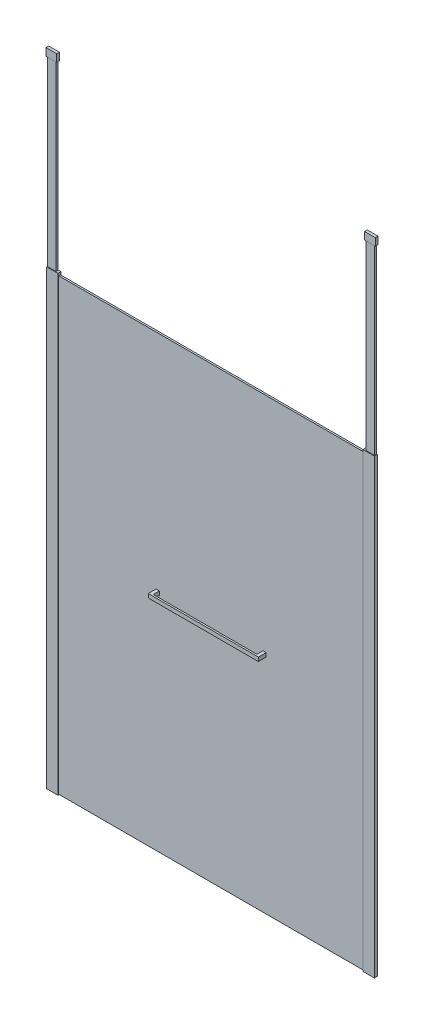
ISO-10303-21;
HEADER;
FILE_DESCRIPTION(('STEP AP214'),'2;1');
FILE_NAME('part.step','',(''),(''),'','','');
FILE_SCHEMA(('AUTOMOTIVE_DESIGN { 1 0 10303 214 1 1 1 1 }'));
ENDSEC;
DATA;
#1=APPLICATION_CONTEXT('core data for automotive mechanical design processes');
#2=APPLICATION_PROTOCOL_DEFINITION('international standard','automotive_design',2000,#1);
#3=PRODUCT_CONTEXT('',#1,'mechanical');
#4=PRODUCT('Part','Part','',(#3));
#5=PRODUCT_RELATED_PRODUCT_CATEGORY('part','',(#4));
#6=PRODUCT_DEFINITION_FORMATION('','',#4);
#7=PRODUCT_DEFINITION_CONTEXT('part definition',#1,'design');
#8=PRODUCT_DEFINITION('design','',#6,#7);
#9=PRODUCT_DEFINITION_SHAPE('','',#8);
#10=(LENGTH_UNIT() NAMED_UNIT(*) SI_UNIT(.MILLI.,.METRE.));
#11=(NAMED_UNIT(*) PLANE_ANGLE_UNIT() SI_UNIT($,.RADIAN.));
#12=(NAMED_UNIT(*) SI_UNIT($,.STERADIAN.) SOLID_ANGLE_UNIT());
#13=UNCERTAINTY_MEASURE_WITH_UNIT(LENGTH_MEASURE(1.E-05),#10,'distance_accuracy_value','');
#14=(GEOMETRIC_REPRESENTATION_CONTEXT(3) GLOBAL_UNCERTAINTY_ASSIGNED_CONTEXT((#13)) GLOBAL_UNIT_ASSIGNED_CONTEXT((#10,
#11,#12)) REPRESENTATION_CONTEXT('',''));
#15=CARTESIAN_POINT('',(0.,0.,0.));
#16=DIRECTION('',(0.,0.,1.));
#17=DIRECTION('',(1.,0.,0.));
#18=AXIS2_PLACEMENT_3D('',#15,#16,#17);
#19=CARTESIAN_POINT('',(523.9,1062.,-21.));
#20=DIRECTION('',(1.,0.,0.));
#21=DIRECTION('',(0.,0.,-1.));
#22=AXIS2_PLACEMENT_3D('',#19,#20,#21);
#23=PLANE('',#22);
#24=DIRECTION('',(0.,1.,0.));
#25=VECTOR('',#24,1.);
#26=CARTESIAN_POINT('',(523.9,1062.,25.5));
#27=LINE('',#26,#25);
#28=CARTESIAN_POINT('',(523.9,1044.,25.5));
#29=VERTEX_POINT('',#28);
#30=CARTESIAN_POINT('',(523.9,1062.,25.5));
#31=VERTEX_POINT('',#30);
#32=EDGE_CURVE('E63',#29,#31,#27,.T.);
#33=ORIENTED_EDGE('',*,*,#32,.F.);
#34=DIRECTION('',(0.,0.,1.));
#35=VECTOR('',#34,1.);
#36=CARTESIAN_POINT('',(523.9,1044.,-21.));
#37=LINE('',#36,#35);
#38=CARTESIAN_POINT('',(523.9,1044.,-21.));
#39=VERTEX_POINT('',#38);
#40=EDGE_CURVE('E12',#39,#29,#37,.T.);
#41=ORIENTED_EDGE('',*,*,#40,.F.);
#42=DIRECTION('',(0.,1.,0.));
#43=VECTOR('',#42,1.);
#44=CARTESIAN_POINT('',(523.9,1062.,-21.));
#45=LINE('',#44,#43);
#46=CARTESIAN_POINT('',(523.9,1062.,-21.));
#47=VERTEX_POINT('',#46);
#48=EDGE_CURVE('E193',#39,#47,#45,.T.);
#49=ORIENTED_EDGE('',*,*,#48,.T.);
#50=DIRECTION('',(0.,0.,1.));
#51=VECTOR('',#50,1.);
#52=CARTESIAN_POINT('',(523.9,1062.,-21.));
#53=LINE('',#52,#51);
#54=EDGE_CURVE('E176',#47,#31,#53,.T.);
#55=ORIENTED_EDGE('',*,*,#54,.T.);
#56=EDGE_LOOP('',(#33,#41,#49,#55));
#57=FACE_BOUND('',#56,.T.);
#58=ADVANCED_FACE('F46',(#57),#23,.T.);
#59=CARTESIAN_POINT('',(508.9,1044.,-21.));
#60=DIRECTION('',(0.,-1.,0.));
#61=DIRECTION('',(0.,0.,-1.));
#62=AXIS2_PLACEMENT_3D('',#59,#60,#61);
#63=PLANE('',#62);
#64=ORIENTED_EDGE('',*,*,#40,.T.);
#65=DIRECTION('',(-1.,0.,0.));
#66=VECTOR('',#65,1.);
#67=CARTESIAN_POINT('',(1028.59771560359,1044.,25.5));
#68=LINE('',#67,#66);
#69=CARTESIAN_POINT('',(1008.9,1044.,25.5));
#70=VERTEX_POINT('',#69);
#71=EDGE_CURVE('E166',#70,#29,#68,.T.);
#72=ORIENTED_EDGE('',*,*,#71,.F.);
#73=DIRECTION('',(0.,0.,1.));
#74=VECTOR('',#73,1.);
#75=CARTESIAN_POINT('',(1008.9,1044.,-21.));
#76=LINE('',#75,#74);
#77=CARTESIAN_POINT('',(1008.9,1044.,-21.));
#78=VERTEX_POINT('',#77);
#79=EDGE_CURVE('E149',#78,#70,#76,.T.);
#80=ORIENTED_EDGE('',*,*,#79,.F.);
#81=DIRECTION('',(1.,0.,0.));
#82=VECTOR('',#81,1.);
#83=CARTESIAN_POINT('',(1008.9,1044.,-21.));
#84=LINE('',#83,#82);
#85=CARTESIAN_POINT('',(1023.9,1044.,-21.));
#86=VERTEX_POINT('',#85);
#87=EDGE_CURVE('E131',#78,#86,#84,.T.);
#88=ORIENTED_EDGE('',*,*,#87,.T.);
#89=DIRECTION('',(0.,0.,1.));
#90=VECTOR('',#89,1.);
#91=CARTESIAN_POINT('',(1023.9,1044.,-21.));
#92=LINE('',#91,#90);
#93=CARTESIAN_POINT('',(1023.9,1044.,33.5));
#94=VERTEX_POINT('',#93);
#95=EDGE_CURVE('E147',#86,#94,#92,.T.);
#96=ORIENTED_EDGE('',*,*,#95,.T.);
#97=DIRECTION('',(1.,0.,0.));
#98=VECTOR('',#97,1.);
#99=CARTESIAN_POINT('',(508.9,1044.,33.5));
#100=LINE('',#99,#98);
#101=CARTESIAN_POINT('',(508.9,1044.,33.5));
#102=VERTEX_POINT('',#101);
#103=EDGE_CURVE('E135',#102,#94,#100,.T.);
#104=ORIENTED_EDGE('',*,*,#103,.F.);
#105=DIRECTION('',(0.,0.,1.));
#106=VECTOR('',#105,1.);
#107=CARTESIAN_POINT('',(508.9,1044.,-21.));
#108=LINE('',#107,#106);
#109=CARTESIAN_POINT('',(508.9,1044.,-21.));
#110=VERTEX_POINT('',#109);
#111=EDGE_CURVE('E55',#110,#102,#108,.T.);
#112=ORIENTED_EDGE('',*,*,#111,.F.);
#113=DIRECTION('',(1.,0.,0.));
#114=VECTOR('',#113,1.);
#115=CARTESIAN_POINT('',(508.9,1044.,-21.));
#116=LINE('',#115,#114);
#117=EDGE_CURVE('E181',#110,#39,#116,.T.);
#118=ORIENTED_EDGE('',*,*,#117,.T.);
#119=EDGE_LOOP('',(#64,#72,#80,#88,#96,#104,#112,#118));
#120=FACE_BOUND('',#119,.T.);
#121=ADVANCED_FACE('F197',(#120),#63,.T.);
#122=CARTESIAN_POINT('',(508.9,1062.,-21.));
#123=DIRECTION('',(-1.,0.,0.));
#124=DIRECTION('',(0.,0.,1.));
#125=AXIS2_PLACEMENT_3D('',#122,#123,#124);
#126=PLANE('',#125);
#127=ORIENTED_EDGE('',*,*,#111,.T.);
#128=DIRECTION('',(0.,-1.,0.));
#129=VECTOR('',#128,1.);
#130=CARTESIAN_POINT('',(508.9,1062.,33.5));
#131=LINE('',#130,#129);
#132=CARTESIAN_POINT('',(508.9,1062.,33.5));
#133=VERTEX_POINT('',#132);
#134=EDGE_CURVE('E121',#133,#102,#131,.T.);
#135=ORIENTED_EDGE('',*,*,#134,.F.);
#136=DIRECTION('',(0.,0.,1.));
#137=VECTOR('',#136,1.);
#138=CARTESIAN_POINT('',(508.9,1062.,-21.));
#139=LINE('',#138,#137);
#140=CARTESIAN_POINT('',(508.9,1062.,-21.));
#141=VERTEX_POINT('',#140);
#142=EDGE_CURVE('E116',#141,#133,#139,.T.);
#143=ORIENTED_EDGE('',*,*,#142,.F.);
#144=DIRECTION('',(0.,-1.,0.));
#145=VECTOR('',#144,1.);
#146=CARTESIAN_POINT('',(508.9,1062.,-21.));
#147=LINE('',#146,#145);
#148=EDGE_CURVE('E186',#141,#110,#147,.T.);
#149=ORIENTED_EDGE('',*,*,#148,.T.);
#150=EDGE_LOOP('',(#127,#135,#143,#149));
#151=FACE_BOUND('',#150,.T.);
#152=ADVANCED_FACE('F218',(#151),#126,.T.);
#153=CARTESIAN_POINT('',(508.9,1062.,-21.));
#154=DIRECTION('',(0.,1.,0.));
#155=DIRECTION('',(0.,0.,1.));
#156=AXIS2_PLACEMENT_3D('',#153,#154,#155);
#157=PLANE('',#156);
#158=ORIENTED_EDGE('',*,*,#142,.T.);
#159=DIRECTION('',(-1.,0.,0.));
#160=VECTOR('',#159,1.);
#161=CARTESIAN_POINT('',(508.9,1062.,33.5));
#162=LINE('',#161,#160);
#163=CARTESIAN_POINT('',(1023.9,1062.,33.5));
#164=VERTEX_POINT('',#163);
#165=EDGE_CURVE('E109',#164,#133,#162,.T.);
#166=ORIENTED_EDGE('',*,*,#165,.F.);
#167=DIRECTION('',(0.,0.,1.));
#168=VECTOR('',#167,1.);
#169=CARTESIAN_POINT('',(1023.9,1062.,-21.));
#170=LINE('',#169,#168);
#171=CARTESIAN_POINT('',(1023.9,1062.,-21.));
#172=VERTEX_POINT('',#171);
#173=EDGE_CURVE('E113',#172,#164,#170,.T.);
#174=ORIENTED_EDGE('',*,*,#173,.F.);
#175=DIRECTION('',(-1.,0.,0.));
#176=VECTOR('',#175,1.);
#177=CARTESIAN_POINT('',(1008.9,1062.,-21.));
#178=LINE('',#177,#176);
#179=CARTESIAN_POINT('',(1008.9,1062.,-21.));
#180=VERTEX_POINT('',#179);
#181=EDGE_CURVE('E138',#172,#180,#178,.T.);
#182=ORIENTED_EDGE('',*,*,#181,.T.);
#183=DIRECTION('',(0.,0.,1.));
#184=VECTOR('',#183,1.);
#185=CARTESIAN_POINT('',(1008.9,1062.,-21.));
#186=LINE('',#185,#184);
#187=CARTESIAN_POINT('',(1008.9,1062.,25.5));
#188=VERTEX_POINT('',#187);
#189=EDGE_CURVE('E130',#180,#188,#186,.T.);
#190=ORIENTED_EDGE('',*,*,#189,.T.);
#191=DIRECTION('',(-1.,0.,0.));
#192=VECTOR('',#191,1.);
#193=CARTESIAN_POINT('',(1028.59771560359,1062.,25.5));
#194=LINE('',#193,#192);
#195=EDGE_CURVE('E163',#188,#31,#194,.T.);
#196=ORIENTED_EDGE('',*,*,#195,.T.);
#197=ORIENTED_EDGE('',*,*,#54,.F.);
#198=DIRECTION('',(-1.,0.,0.));
#199=VECTOR('',#198,1.);
#200=CARTESIAN_POINT('',(508.9,1062.,-21.));
#201=LINE('',#200,#199);
#202=EDGE_CURVE('E190',#47,#141,#201,.T.);
#203=ORIENTED_EDGE('',*,*,#202,.T.);
#204=EDGE_LOOP('',(#158,#166,#174,#182,#190,#196,#197,#203));
#205=FACE_BOUND('',#204,.T.);
#206=ADVANCED_FACE('F111',(#205),#157,.T.);
#207=CARTESIAN_POINT('',(523.9,1044.,-21.));
#208=DIRECTION('',(0.,0.,1.));
#209=DIRECTION('',(1.,0.,0.));
#210=AXIS2_PLACEMENT_3D('',#207,#208,#209);
#211=PLANE('',#210);
#212=ORIENTED_EDGE('',*,*,#48,.F.);
#213=ORIENTED_EDGE('',*,*,#117,.F.);
#214=ORIENTED_EDGE('',*,*,#148,.F.);
#215=ORIENTED_EDGE('',*,*,#202,.F.);
#216=EDGE_LOOP('',(#212,#213,#214,#215));
#217=FACE_BOUND('',#216,.T.);
#218=ADVANCED_FACE('F225',(#217),#211,.F.);
#219=CARTESIAN_POINT('',(523.9,1044.,33.5));
#220=DIRECTION('',(0.,0.,1.));
#221=DIRECTION('',(1.,0.,0.));
#222=AXIS2_PLACEMENT_3D('',#219,#220,#221);
#223=PLANE('',#222);
#224=ORIENTED_EDGE('',*,*,#103,.T.);
#225=DIRECTION('',(0.,1.,0.));
#226=VECTOR('',#225,1.);
#227=CARTESIAN_POINT('',(1023.9,1062.,33.5));
#228=LINE('',#227,#226);
#229=EDGE_CURVE('E127',#94,#164,#228,.T.);
#230=ORIENTED_EDGE('',*,*,#229,.T.);
#231=ORIENTED_EDGE('',*,*,#165,.T.);
#232=ORIENTED_EDGE('',*,*,#134,.T.);
#233=EDGE_LOOP('',(#224,#230,#231,#232));
#234=FACE_BOUND('',#233,.T.);
#235=ADVANCED_FACE('F133',(#234),#223,.T.);
#236=CARTESIAN_POINT('',(1028.59771560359,1062.,25.5));
#237=DIRECTION('',(0.,0.,1.));
#238=DIRECTION('',(0.,-1.,0.));
#239=AXIS2_PLACEMENT_3D('',#236,#237,#238);
#240=PLANE('',#239);
#241=ORIENTED_EDGE('',*,*,#195,.F.);
#242=DIRECTION('',(0.,-1.,0.));
#243=VECTOR('',#242,1.);
#244=CARTESIAN_POINT('',(1008.9,1062.,25.5));
#245=LINE('',#244,#243);
#246=EDGE_CURVE('E49',#188,#70,#245,.T.);
#247=ORIENTED_EDGE('',*,*,#246,.T.);
#248=ORIENTED_EDGE('',*,*,#71,.T.);
#249=ORIENTED_EDGE('',*,*,#32,.T.);
#250=EDGE_LOOP('',(#241,#247,#248,#249));
#251=FACE_BOUND('',#250,.T.);
#252=ADVANCED_FACE('F203',(#251),#240,.F.);
#253=CARTESIAN_POINT('',(1008.9,1062.,-21.));
#254=DIRECTION('',(-1.,0.,0.));
#255=DIRECTION('',(0.,0.,1.));
#256=AXIS2_PLACEMENT_3D('',#253,#254,#255);
#257=PLANE('',#256);
#258=ORIENTED_EDGE('',*,*,#246,.F.);
#259=ORIENTED_EDGE('',*,*,#189,.F.);
#260=DIRECTION('',(0.,-1.,0.));
#261=VECTOR('',#260,1.);
#262=CARTESIAN_POINT('',(1008.9,1062.,-21.));
#263=LINE('',#262,#261);
#264=EDGE_CURVE('E142',#180,#78,#263,.T.);
#265=ORIENTED_EDGE('',*,*,#264,.T.);
#266=ORIENTED_EDGE('',*,*,#79,.T.);
#267=EDGE_LOOP('',(#258,#259,#265,#266));
#268=FACE_BOUND('',#267,.T.);
#269=ADVANCED_FACE('F204',(#268),#257,.T.);
#270=CARTESIAN_POINT('',(1023.9,1062.,-21.));
#271=DIRECTION('',(1.,0.,0.));
#272=DIRECTION('',(0.,0.,-1.));
#273=AXIS2_PLACEMENT_3D('',#270,#271,#272);
#274=PLANE('',#273);
#275=ORIENTED_EDGE('',*,*,#173,.T.);
#276=ORIENTED_EDGE('',*,*,#229,.F.);
#277=ORIENTED_EDGE('',*,*,#95,.F.);
#278=DIRECTION('',(0.,1.,0.));
#279=VECTOR('',#278,1.);
#280=CARTESIAN_POINT('',(1023.9,1062.,-21.));
#281=LINE('',#280,#279);
#282=EDGE_CURVE('E129',#86,#172,#281,.T.);
#283=ORIENTED_EDGE('',*,*,#282,.T.);
#284=EDGE_LOOP('',(#275,#276,#277,#283));
#285=FACE_BOUND('',#284,.T.);
#286=ADVANCED_FACE('F126',(#285),#274,.T.);
#287=CARTESIAN_POINT('',(1023.9,1044.,-21.));
#288=DIRECTION('',(0.,0.,1.));
#289=DIRECTION('',(1.,0.,0.));
#290=AXIS2_PLACEMENT_3D('',#287,#288,#289);
#291=PLANE('',#290);
#292=ORIENTED_EDGE('',*,*,#282,.F.);
#293=ORIENTED_EDGE('',*,*,#87,.F.);
#294=ORIENTED_EDGE('',*,*,#264,.F.);
#295=ORIENTED_EDGE('',*,*,#181,.F.);
#296=EDGE_LOOP('',(#292,#293,#294,#295));
#297=FACE_BOUND('',#296,.T.);
#298=ADVANCED_FACE('F200',(#297),#291,.F.);
#299=CLOSED_SHELL('',(#58,#121,#152,#206,#218,#235,#252,#269,#286,#298));
#300=MANIFOLD_SOLID_BREP('B2',#299);
#301=CARTESIAN_POINT('',(46.5,3000.,-13.2499999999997));
#302=DIRECTION('',(-1.,0.,0.));
#303=DIRECTION('',(0.,-1.,0.));
#304=AXIS2_PLACEMENT_3D('',#301,#302,#303);
#305=PLANE('',#304);
#306=DIRECTION('',(0.,0.,-1.));
#307=VECTOR('',#306,1.);
#308=CARTESIAN_POINT('',(46.5,2965.,-13.2499999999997));
#309=LINE('',#308,#307);
#310=CARTESIAN_POINT('',(46.5,2965.,-0.749999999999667));
#311=VERTEX_POINT('',#310);
#312=CARTESIAN_POINT('',(46.5,2965.,-13.2499999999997));
#313=VERTEX_POINT('',#312);
#314=EDGE_CURVE('E381',#311,#313,#309,.T.);
#315=ORIENTED_EDGE('',*,*,#314,.T.);
#316=DIRECTION('',(0.,-1.,0.));
#317=VECTOR('',#316,1.);
#318=CARTESIAN_POINT('',(46.5,3000.,-13.2499999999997));
#319=LINE('',#318,#317);
#320=CARTESIAN_POINT('',(46.5,3000.,-13.2499999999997));
#321=VERTEX_POINT('',#320);
#322=EDGE_CURVE('E44',#321,#313,#319,.T.);
#323=ORIENTED_EDGE('',*,*,#322,.F.);
#324=DIRECTION('',(0.,0.,-1.));
#325=VECTOR('',#324,1.);
#326=CARTESIAN_POINT('',(46.5,3000.,-13.2499999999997));
#327=LINE('',#326,#325);
#328=CARTESIAN_POINT('',(46.5,3000.,-0.74999999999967));
#329=VERTEX_POINT('',#328);
#330=EDGE_CURVE('E369',#329,#321,#327,.T.);
#331=ORIENTED_EDGE('',*,*,#330,.F.);
#332=DIRECTION('',(0.,-1.,0.));
#333=VECTOR('',#332,1.);
#334=CARTESIAN_POINT('',(46.5,3000.,-0.74999999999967));
#335=LINE('',#334,#333);
#336=EDGE_CURVE('E377',#329,#311,#335,.T.);
#337=ORIENTED_EDGE('',*,*,#336,.T.);
#338=EDGE_LOOP('',(#315,#323,#331,#337));
#339=FACE_BOUND('',#338,.T.);
#340=ADVANCED_FACE('F318',(#339),#305,.F.);
#341=CARTESIAN_POINT('',(-3.5,3000.,-13.2499999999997));
#342=DIRECTION('',(0.,0.,1.));
#343=DIRECTION('',(0.,-1.,0.));
#344=AXIS2_PLACEMENT_3D('',#341,#342,#343);
#345=PLANE('',#344);
#346=DIRECTION('',(-1.,0.,0.));
#347=VECTOR('',#346,1.);
#348=CARTESIAN_POINT('',(-3.5,2965.,-13.2499999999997));
#349=LINE('',#348,#347);
#350=CARTESIAN_POINT('',(-3.5,2965.,-13.2499999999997));
#351=VERTEX_POINT('',#350);
#352=EDGE_CURVE('E373',#313,#351,#349,.T.);
#353=ORIENTED_EDGE('',*,*,#352,.T.);
#354=DIRECTION('',(0.,-1.,0.));
#355=VECTOR('',#354,1.);
#356=CARTESIAN_POINT('',(-3.5,3000.,-13.2499999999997));
#357=LINE('',#356,#355);
#358=CARTESIAN_POINT('',(-3.5,3000.,-13.2499999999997));
#359=VERTEX_POINT('',#358);
#360=EDGE_CURVE('E326',#359,#351,#357,.T.);
#361=ORIENTED_EDGE('',*,*,#360,.F.);
#362=DIRECTION('',(-1.,0.,0.));
#363=VECTOR('',#362,1.);
#364=CARTESIAN_POINT('',(-3.5,3000.,-13.2499999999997));
#365=LINE('',#364,#363);
#366=EDGE_CURVE('E364',#321,#359,#365,.T.);
#367=ORIENTED_EDGE('',*,*,#366,.F.);
#368=ORIENTED_EDGE('',*,*,#322,.T.);
#369=EDGE_LOOP('',(#353,#361,#367,#368));
#370=FACE_BOUND('',#369,.T.);
#371=ADVANCED_FACE('F372',(#370),#345,.F.);
#372=CARTESIAN_POINT('',(-3.5,3000.,-13.2499999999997));
#373=DIRECTION('',(1.,0.,0.));
#374=DIRECTION('',(0.,0.,-1.));
#375=AXIS2_PLACEMENT_3D('',#372,#373,#374);
#376=PLANE('',#375);
#377=DIRECTION('',(0.,0.,1.));
#378=VECTOR('',#377,1.);
#379=CARTESIAN_POINT('',(-3.5,2965.,-13.2499999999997));
#380=LINE('',#379,#378);
#381=CARTESIAN_POINT('',(-3.5,2965.,-0.749999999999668));
#382=VERTEX_POINT('',#381);
#383=EDGE_CURVE('E351',#351,#382,#380,.T.);
#384=ORIENTED_EDGE('',*,*,#383,.T.);
#385=DIRECTION('',(0.,-1.,0.));
#386=VECTOR('',#385,1.);
#387=CARTESIAN_POINT('',(-3.5,3000.,-0.74999999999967));
#388=LINE('',#387,#386);
#389=CARTESIAN_POINT('',(-3.5,3000.,-0.74999999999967));
#390=VERTEX_POINT('',#389);
#391=EDGE_CURVE('E374',#390,#382,#388,.T.);
#392=ORIENTED_EDGE('',*,*,#391,.F.);
#393=DIRECTION('',(0.,0.,1.));
#394=VECTOR('',#393,1.);
#395=CARTESIAN_POINT('',(-3.5,3000.,-13.2499999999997));
#396=LINE('',#395,#394);
#397=EDGE_CURVE('E367',#359,#390,#396,.T.);
#398=ORIENTED_EDGE('',*,*,#397,.F.);
#399=ORIENTED_EDGE('',*,*,#360,.T.);
#400=EDGE_LOOP('',(#384,#392,#398,#399));
#401=FACE_BOUND('',#400,.T.);
#402=ADVANCED_FACE('F375',(#401),#376,.F.);
#403=CARTESIAN_POINT('',(-3.5,3000.,-0.74999999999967));
#404=DIRECTION('',(0.,0.,-1.));
#405=DIRECTION('',(0.,1.,0.));
#406=AXIS2_PLACEMENT_3D('',#403,#404,#405);
#407=PLANE('',#406);
#408=DIRECTION('',(1.,0.,0.));
#409=VECTOR('',#408,1.);
#410=CARTESIAN_POINT('',(-3.5,2965.,-0.749999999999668));
#411=LINE('',#410,#409);
#412=EDGE_CURVE('E357',#382,#311,#411,.T.);
#413=ORIENTED_EDGE('',*,*,#412,.T.);
#414=ORIENTED_EDGE('',*,*,#336,.F.);
#415=DIRECTION('',(1.,0.,0.));
#416=VECTOR('',#415,1.);
#417=CARTESIAN_POINT('',(-3.5,3000.,-0.74999999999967));
#418=LINE('',#417,#416);
#419=EDGE_CURVE('E334',#390,#329,#418,.T.);
#420=ORIENTED_EDGE('',*,*,#419,.F.);
#421=ORIENTED_EDGE('',*,*,#391,.T.);
#422=EDGE_LOOP('',(#413,#414,#420,#421));
#423=FACE_BOUND('',#422,.T.);
#424=ADVANCED_FACE('F388',(#423),#407,.F.);
#425=CARTESIAN_POINT('',(46.5,3000.,-0.74999999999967));
#426=DIRECTION('',(0.,1.,0.));
#427=DIRECTION('',(0.,0.,1.));
#428=AXIS2_PLACEMENT_3D('',#425,#426,#427);
#429=PLANE('',#428);
#430=ORIENTED_EDGE('',*,*,#330,.T.);
#431=ORIENTED_EDGE('',*,*,#366,.T.);
#432=ORIENTED_EDGE('',*,*,#397,.T.);
#433=ORIENTED_EDGE('',*,*,#419,.T.);
#434=EDGE_LOOP('',(#430,#431,#432,#433));
#435=FACE_BOUND('',#434,.T.);
#436=ADVANCED_FACE('F365',(#435),#429,.T.);
#437=CARTESIAN_POINT('',(46.5,2965.,-0.749999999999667));
#438=DIRECTION('',(0.,1.,0.));
#439=DIRECTION('',(0.,0.,1.));
#440=AXIS2_PLACEMENT_3D('',#437,#438,#439);
#441=PLANE('',#440);
#442=ORIENTED_EDGE('',*,*,#314,.F.);
#443=ORIENTED_EDGE('',*,*,#412,.F.);
#444=ORIENTED_EDGE('',*,*,#383,.F.);
#445=ORIENTED_EDGE('',*,*,#352,.F.);
#446=EDGE_LOOP('',(#442,#443,#444,#445));
#447=FACE_BOUND('',#446,.T.);
#448=ADVANCED_FACE('F391',(#447),#441,.F.);
#449=CLOSED_SHELL('',(#340,#371,#402,#424,#436,#448));
#450=MANIFOLD_SOLID_BREP('B6',#449);
#451=CARTESIAN_POINT('',(1.5,2997.,-2.99999999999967));
#452=DIRECTION('',(-1.,0.,0.));
#453=DIRECTION('',(0.,0.,1.));
#454=AXIS2_PLACEMENT_3D('',#451,#452,#453);
#455=PLANE('',#454);
#456=DIRECTION('',(0.,0.,-1.));
#457=VECTOR('',#456,1.);
#458=CARTESIAN_POINT('',(1.5,2114.,-2.99999999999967));
#459=LINE('',#458,#457);
#460=CARTESIAN_POINT('',(1.5,2114.,-2.99999999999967));
#461=VERTEX_POINT('',#460);
#462=CARTESIAN_POINT('',(1.5,2114.,-10.9999999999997));
#463=VERTEX_POINT('',#462);
#464=EDGE_CURVE('E516',#461,#463,#459,.T.);
#465=ORIENTED_EDGE('',*,*,#464,.F.);
#466=DIRECTION('',(0.,-1.,0.));
#467=VECTOR('',#466,1.);
#468=CARTESIAN_POINT('',(1.5,2997.,-2.99999999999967));
#469=LINE('',#468,#467);
#470=CARTESIAN_POINT('',(1.5,2997.,-2.99999999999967));
#471=VERTEX_POINT('',#470);
#472=EDGE_CURVE('E316',#471,#461,#469,.T.);
#473=ORIENTED_EDGE('',*,*,#472,.F.);
#474=DIRECTION('',(0.,0.,-1.));
#475=VECTOR('',#474,1.);
#476=CARTESIAN_POINT('',(1.5,2997.,-2.99999999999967));
#477=LINE('',#476,#475);
#478=CARTESIAN_POINT('',(1.5,2997.,-10.9999999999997));
#479=VERTEX_POINT('',#478);
#480=EDGE_CURVE('E510',#471,#479,#477,.T.);
#481=ORIENTED_EDGE('',*,*,#480,.T.);
#482=DIRECTION('',(0.,-1.,0.));
#483=VECTOR('',#482,1.);
#484=CARTESIAN_POINT('',(1.5,2997.,-10.9999999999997));
#485=LINE('',#484,#483);
#486=EDGE_CURVE('E455',#479,#463,#485,.T.);
#487=ORIENTED_EDGE('',*,*,#486,.T.);
#488=EDGE_LOOP('',(#465,#473,#481,#487));
#489=FACE_BOUND('',#488,.T.);
#490=ADVANCED_FACE('F452',(#489),#455,.T.);
#491=CARTESIAN_POINT('',(1.5,2997.,-2.99999999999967));
#492=DIRECTION('',(0.,0.,1.));
#493=DIRECTION('',(1.,0.,0.));
#494=AXIS2_PLACEMENT_3D('',#491,#492,#493);
#495=PLANE('',#494);
#496=DIRECTION('',(-1.,0.,0.));
#497=VECTOR('',#496,1.);
#498=CARTESIAN_POINT('',(1.5,2114.,-2.99999999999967));
#499=LINE('',#498,#497);
#500=CARTESIAN_POINT('',(41.5,2114.,-2.99999999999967));
#501=VERTEX_POINT('',#500);
#502=EDGE_CURVE('E512',#501,#461,#499,.T.);
#503=ORIENTED_EDGE('',*,*,#502,.F.);
#504=DIRECTION('',(0.,-1.,0.));
#505=VECTOR('',#504,1.);
#506=CARTESIAN_POINT('',(41.5,2997.,-2.99999999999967));
#507=LINE('',#506,#505);
#508=CARTESIAN_POINT('',(41.5,2997.,-2.99999999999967));
#509=VERTEX_POINT('',#508);
#510=EDGE_CURVE('E461',#509,#501,#507,.T.);
#511=ORIENTED_EDGE('',*,*,#510,.F.);
#512=DIRECTION('',(-1.,0.,0.));
#513=VECTOR('',#512,1.);
#514=CARTESIAN_POINT('',(1.5,2997.,-2.99999999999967));
#515=LINE('',#514,#513);
#516=EDGE_CURVE('E507',#509,#471,#515,.T.);
#517=ORIENTED_EDGE('',*,*,#516,.T.);
#518=ORIENTED_EDGE('',*,*,#472,.T.);
#519=EDGE_LOOP('',(#503,#511,#517,#518));
#520=FACE_BOUND('',#519,.T.);
#521=ADVANCED_FACE('F526',(#520),#495,.T.);
#522=CARTESIAN_POINT('',(41.5,2997.,-2.99999999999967));
#523=DIRECTION('',(1.,0.,0.));
#524=DIRECTION('',(0.,0.,-1.));
#525=AXIS2_PLACEMENT_3D('',#522,#523,#524);
#526=PLANE('',#525);
#527=DIRECTION('',(0.,0.,1.));
#528=VECTOR('',#527,1.);
#529=CARTESIAN_POINT('',(41.5,2114.,-2.99999999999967));
#530=LINE('',#529,#528);
#531=CARTESIAN_POINT('',(41.5,2114.,-10.9999999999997));
#532=VERTEX_POINT('',#531);
#533=EDGE_CURVE('E502',#532,#501,#530,.T.);
#534=ORIENTED_EDGE('',*,*,#533,.F.);
#535=DIRECTION('',(0.,-1.,0.));
#536=VECTOR('',#535,1.);
#537=CARTESIAN_POINT('',(41.5,2997.,-10.9999999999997));
#538=LINE('',#537,#536);
#539=CARTESIAN_POINT('',(41.5,2997.,-10.9999999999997));
#540=VERTEX_POINT('',#539);
#541=EDGE_CURVE('E497',#540,#532,#538,.T.);
#542=ORIENTED_EDGE('',*,*,#541,.F.);
#543=DIRECTION('',(0.,0.,1.));
#544=VECTOR('',#543,1.);
#545=CARTESIAN_POINT('',(41.5,2997.,-2.99999999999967));
#546=LINE('',#545,#544);
#547=EDGE_CURVE('E500',#540,#509,#546,.T.);
#548=ORIENTED_EDGE('',*,*,#547,.T.);
#549=ORIENTED_EDGE('',*,*,#510,.T.);
#550=EDGE_LOOP('',(#534,#542,#548,#549));
#551=FACE_BOUND('',#550,.T.);
#552=ADVANCED_FACE('F499',(#551),#526,.T.);
#553=CARTESIAN_POINT('',(1.5,2997.,-10.9999999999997));
#554=DIRECTION('',(0.,0.,-1.));
#555=DIRECTION('',(-1.,0.,0.));
#556=AXIS2_PLACEMENT_3D('',#553,#554,#555);
#557=PLANE('',#556);
#558=DIRECTION('',(1.,0.,0.));
#559=VECTOR('',#558,1.);
#560=CARTESIAN_POINT('',(1.5,2114.,-10.9999999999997));
#561=LINE('',#560,#559);
#562=EDGE_CURVE('E519',#463,#532,#561,.T.);
#563=ORIENTED_EDGE('',*,*,#562,.F.);
#564=ORIENTED_EDGE('',*,*,#486,.F.);
#565=DIRECTION('',(1.,0.,0.));
#566=VECTOR('',#565,1.);
#567=CARTESIAN_POINT('',(1.5,2997.,-10.9999999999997));
#568=LINE('',#567,#566);
#569=EDGE_CURVE('E506',#479,#540,#568,.T.);
#570=ORIENTED_EDGE('',*,*,#569,.T.);
#571=ORIENTED_EDGE('',*,*,#541,.T.);
#572=EDGE_LOOP('',(#563,#564,#570,#571));
#573=FACE_BOUND('',#572,.T.);
#574=ADVANCED_FACE('F509',(#573),#557,.T.);
#575=CARTESIAN_POINT('',(1.5,2997.,-10.9999999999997));
#576=DIRECTION('',(0.,-1.,0.));
#577=DIRECTION('',(0.,0.,-1.));
#578=AXIS2_PLACEMENT_3D('',#575,#576,#577);
#579=PLANE('',#578);
#580=ORIENTED_EDGE('',*,*,#480,.F.);
#581=ORIENTED_EDGE('',*,*,#516,.F.);
#582=ORIENTED_EDGE('',*,*,#547,.F.);
#583=ORIENTED_EDGE('',*,*,#569,.F.);
#584=EDGE_LOOP('',(#580,#581,#582,#583));
#585=FACE_BOUND('',#584,.T.);
#586=ADVANCED_FACE('F505',(#585),#579,.F.);
#587=CARTESIAN_POINT('',(1.5,2114.,-10.9999999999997));
#588=DIRECTION('',(0.,-1.,0.));
#589=DIRECTION('',(0.,0.,-1.));
#590=AXIS2_PLACEMENT_3D('',#587,#588,#589);
#591=PLANE('',#590);
#592=ORIENTED_EDGE('',*,*,#464,.T.);
#593=ORIENTED_EDGE('',*,*,#562,.T.);
#594=ORIENTED_EDGE('',*,*,#533,.T.);
#595=ORIENTED_EDGE('',*,*,#502,.T.);
#596=EDGE_LOOP('',(#592,#593,#594,#595));
#597=FACE_BOUND('',#596,.T.);
#598=ADVANCED_FACE('F525',(#597),#591,.T.);
#599=CLOSED_SHELL('',(#490,#521,#552,#574,#586,#598));
#600=MANIFOLD_SOLID_BREP('B38',#599);
#601=CARTESIAN_POINT('',(1486.3,3000.,-0.749999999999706));
#602=DIRECTION('',(1.,0.,0.));
#603=DIRECTION('',(0.,1.,0.));
#604=AXIS2_PLACEMENT_3D('',#601,#602,#603);
#605=PLANE('',#604);
#606=DIRECTION('',(0.,0.,1.));
#607=VECTOR('',#606,1.);
#608=CARTESIAN_POINT('',(1486.3,2965.,-0.749999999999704));
#609=LINE('',#608,#607);
#610=CARTESIAN_POINT('',(1486.3,2965.,-13.2499999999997));
#611=VERTEX_POINT('',#610);
#612=CARTESIAN_POINT('',(1486.3,2965.,-0.749999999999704));
#613=VERTEX_POINT('',#612);
#614=EDGE_CURVE('E674',#611,#613,#609,.T.);
#615=ORIENTED_EDGE('',*,*,#614,.T.);
#616=DIRECTION('',(0.,-1.,0.));
#617=VECTOR('',#616,1.);
#618=CARTESIAN_POINT('',(1486.3,3000.,-0.749999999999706));
#619=LINE('',#618,#617);
#620=CARTESIAN_POINT('',(1486.3,3000.,-0.749999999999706));
#621=VERTEX_POINT('',#620);
#622=EDGE_CURVE('E655',#621,#613,#619,.T.);
#623=ORIENTED_EDGE('',*,*,#622,.F.);
#624=DIRECTION('',(0.,0.,1.));
#625=VECTOR('',#624,1.);
#626=CARTESIAN_POINT('',(1486.3,3000.,-0.749999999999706));
#627=LINE('',#626,#625);
#628=CARTESIAN_POINT('',(1486.3,3000.,-13.2499999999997));
#629=VERTEX_POINT('',#628);
#630=EDGE_CURVE('E662',#629,#621,#627,.T.);
#631=ORIENTED_EDGE('',*,*,#630,.F.);
#632=DIRECTION('',(0.,-1.,0.));
#633=VECTOR('',#632,1.);
#634=CARTESIAN_POINT('',(1486.3,3000.,-13.2499999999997));
#635=LINE('',#634,#633);
#636=EDGE_CURVE('E813',#629,#611,#635,.T.);
#637=ORIENTED_EDGE('',*,*,#636,.T.);
#638=EDGE_LOOP('',(#615,#623,#631,#637));
#639=FACE_BOUND('',#638,.T.);
#640=ADVANCED_FACE('F586',(#639),#605,.F.);
#641=CARTESIAN_POINT('',(1536.3,3000.,-0.749999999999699));
#642=DIRECTION('',(0.,0.,-1.));
#643=DIRECTION('',(-1.,0.,0.));
#644=AXIS2_PLACEMENT_3D('',#641,#642,#643);
#645=PLANE('',#644);
#646=DIRECTION('',(1.,0.,0.));
#647=VECTOR('',#646,1.);
#648=CARTESIAN_POINT('',(1536.3,2965.,-0.749999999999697));
#649=LINE('',#648,#647);
#650=CARTESIAN_POINT('',(1536.3,2965.,-0.749999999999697));
#651=VERTEX_POINT('',#650);
#652=EDGE_CURVE('E811',#613,#651,#649,.T.);
#653=ORIENTED_EDGE('',*,*,#652,.T.);
#654=DIRECTION('',(0.,-1.,0.));
#655=VECTOR('',#654,1.);
#656=CARTESIAN_POINT('',(1536.3,3000.,-0.749999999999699));
#657=LINE('',#656,#655);
#658=CARTESIAN_POINT('',(1536.3,3000.,-0.749999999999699));
#659=VERTEX_POINT('',#658);
#660=EDGE_CURVE('E658',#659,#651,#657,.T.);
#661=ORIENTED_EDGE('',*,*,#660,.F.);
#662=DIRECTION('',(1.,0.,0.));
#663=VECTOR('',#662,1.);
#664=CARTESIAN_POINT('',(1536.3,3000.,-0.749999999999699));
#665=LINE('',#664,#663);
#666=EDGE_CURVE('E651',#621,#659,#665,.T.);
#667=ORIENTED_EDGE('',*,*,#666,.F.);
#668=ORIENTED_EDGE('',*,*,#622,.T.);
#669=EDGE_LOOP('',(#653,#661,#667,#668));
#670=FACE_BOUND('',#669,.T.);
#671=ADVANCED_FACE('F653',(#670),#645,.F.);
#672=CARTESIAN_POINT('',(1536.3,3000.,-0.749999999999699));
#673=DIRECTION('',(-1.,0.,0.));
#674=DIRECTION('',(0.,-1.,0.));
#675=AXIS2_PLACEMENT_3D('',#672,#673,#674);
#676=PLANE('',#675);
#677=DIRECTION('',(0.,0.,-1.));
#678=VECTOR('',#677,1.);
#679=CARTESIAN_POINT('',(1536.3,2965.,-0.749999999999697));
#680=LINE('',#679,#678);
#681=CARTESIAN_POINT('',(1536.3,2965.,-13.2499999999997));
#682=VERTEX_POINT('',#681);
#683=EDGE_CURVE('E807',#651,#682,#680,.T.);
#684=ORIENTED_EDGE('',*,*,#683,.T.);
#685=DIRECTION('',(0.,-1.,0.));
#686=VECTOR('',#685,1.);
#687=CARTESIAN_POINT('',(1536.3,3000.,-13.2499999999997));
#688=LINE('',#687,#686);
#689=CARTESIAN_POINT('',(1536.3,3000.,-13.2499999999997));
#690=VERTEX_POINT('',#689);
#691=EDGE_CURVE('E678',#690,#682,#688,.T.);
#692=ORIENTED_EDGE('',*,*,#691,.F.);
#693=DIRECTION('',(0.,0.,-1.));
#694=VECTOR('',#693,1.);
#695=CARTESIAN_POINT('',(1536.3,3000.,-0.749999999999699));
#696=LINE('',#695,#694);
#697=EDGE_CURVE('E661',#659,#690,#696,.T.);
#698=ORIENTED_EDGE('',*,*,#697,.F.);
#699=ORIENTED_EDGE('',*,*,#660,.T.);
#700=EDGE_LOOP('',(#684,#692,#698,#699));
#701=FACE_BOUND('',#700,.T.);
#702=ADVANCED_FACE('F728',(#701),#676,.F.);
#703=CARTESIAN_POINT('',(1536.3,3000.,-13.2499999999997));
#704=DIRECTION('',(0.,0.,1.));
#705=DIRECTION('',(1.,0.,0.));
#706=AXIS2_PLACEMENT_3D('',#703,#704,#705);
#707=PLANE('',#706);
#708=DIRECTION('',(-1.,0.,0.));
#709=VECTOR('',#708,1.);
#710=CARTESIAN_POINT('',(1536.3,2965.,-13.2499999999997));
#711=LINE('',#710,#709);
#712=EDGE_CURVE('E671',#682,#611,#711,.T.);
#713=ORIENTED_EDGE('',*,*,#712,.T.);
#714=ORIENTED_EDGE('',*,*,#636,.F.);
#715=DIRECTION('',(-1.,0.,0.));
#716=VECTOR('',#715,1.);
#717=CARTESIAN_POINT('',(1536.3,3000.,-13.2499999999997));
#718=LINE('',#717,#716);
#719=EDGE_CURVE('E667',#690,#629,#718,.T.);
#720=ORIENTED_EDGE('',*,*,#719,.F.);
#721=ORIENTED_EDGE('',*,*,#691,.T.);
#722=EDGE_LOOP('',(#713,#714,#720,#721));
#723=FACE_BOUND('',#722,.T.);
#724=ADVANCED_FACE('F775',(#723),#707,.F.);
#725=CARTESIAN_POINT('',(1486.3,3000.,-13.2499999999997));
#726=DIRECTION('',(0.,1.,0.));
#727=DIRECTION('',(0.,0.,1.));
#728=AXIS2_PLACEMENT_3D('',#725,#726,#727);
#729=PLANE('',#728);
#730=ORIENTED_EDGE('',*,*,#630,.T.);
#731=ORIENTED_EDGE('',*,*,#666,.T.);
#732=ORIENTED_EDGE('',*,*,#697,.T.);
#733=ORIENTED_EDGE('',*,*,#719,.T.);
#734=EDGE_LOOP('',(#730,#731,#732,#733));
#735=FACE_BOUND('',#734,.T.);
#736=ADVANCED_FACE('F665',(#735),#729,.T.);
#737=CARTESIAN_POINT('',(1486.3,2965.,-13.2499999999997));
#738=DIRECTION('',(0.,1.,0.));
#739=DIRECTION('',(0.,0.,1.));
#740=AXIS2_PLACEMENT_3D('',#737,#738,#739);
#741=PLANE('',#740);
#742=DIRECTION('',(0.,0.,1.));
#743=VECTOR('',#742,1.);
#744=CARTESIAN_POINT('',(1531.3,2965.,-10.9999999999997));
#745=LINE('',#744,#743);
#746=CARTESIAN_POINT('',(1531.3,2965.,-10.9999999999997));
#747=VERTEX_POINT('',#746);
#748=CARTESIAN_POINT('',(1531.3,2965.,-2.99999999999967));
#749=VERTEX_POINT('',#748);
#750=EDGE_CURVE('E683',#747,#749,#745,.T.);
#751=ORIENTED_EDGE('',*,*,#750,.F.);
#752=DIRECTION('',(1.,0.,0.));
#753=VECTOR('',#752,1.);
#754=CARTESIAN_POINT('',(1531.3,2965.,-10.9999999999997));
#755=LINE('',#754,#753);
#756=CARTESIAN_POINT('',(1491.3,2965.,-10.9999999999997));
#757=VERTEX_POINT('',#756);
#758=EDGE_CURVE('E676',#757,#747,#755,.T.);
#759=ORIENTED_EDGE('',*,*,#758,.F.);
#760=DIRECTION('',(0.,0.,-1.));
#761=VECTOR('',#760,1.);
#762=CARTESIAN_POINT('',(1491.3,2965.,-10.9999999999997));
#763=LINE('',#762,#761);
#764=CARTESIAN_POINT('',(1491.3,2965.,-2.99999999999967));
#765=VERTEX_POINT('',#764);
#766=EDGE_CURVE('E601',#765,#757,#763,.T.);
#767=ORIENTED_EDGE('',*,*,#766,.F.);
#768=DIRECTION('',(-1.,0.,0.));
#769=VECTOR('',#768,1.);
#770=CARTESIAN_POINT('',(1531.3,2965.,-2.99999999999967));
#771=LINE('',#770,#769);
#772=EDGE_CURVE('E450',#749,#765,#771,.T.);
#773=ORIENTED_EDGE('',*,*,#772,.F.);
#774=EDGE_LOOP('',(#751,#759,#767,#773));
#775=FACE_BOUND('',#774,.T.);
#776=ORIENTED_EDGE('',*,*,#614,.F.);
#777=ORIENTED_EDGE('',*,*,#712,.F.);
#778=ORIENTED_EDGE('',*,*,#683,.F.);
#779=ORIENTED_EDGE('',*,*,#652,.F.);
#780=EDGE_LOOP('',(#776,#777,#778,#779));
#781=FACE_BOUND('',#780,.T.);
#782=ADVANCED_FACE('F758',(#775,#781),#741,.F.);
#783=CARTESIAN_POINT('',(1531.3,2997.,-10.9999999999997));
#784=DIRECTION('',(1.,0.,0.));
#785=DIRECTION('',(0.,0.,-1.));
#786=AXIS2_PLACEMENT_3D('',#783,#784,#785);
#787=PLANE('',#786);
#788=DIRECTION('',(0.,-1.,0.));
#789=VECTOR('',#788,1.);
#790=CARTESIAN_POINT('',(1531.3,2997.,-10.9999999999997));
#791=LINE('',#790,#789);
#792=CARTESIAN_POINT('',(1531.3,2114.,-10.9999999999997));
#793=VERTEX_POINT('',#792);
#794=EDGE_CURVE('E594',#747,#793,#791,.T.);
#795=ORIENTED_EDGE('',*,*,#794,.F.);
#796=ORIENTED_EDGE('',*,*,#750,.T.);
#797=DIRECTION('',(0.,-1.,0.));
#798=VECTOR('',#797,1.);
#799=CARTESIAN_POINT('',(1531.3,2997.,-2.99999999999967));
#800=LINE('',#799,#798);
#801=CARTESIAN_POINT('',(1531.3,2114.,-2.99999999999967));
#802=VERTEX_POINT('',#801);
#803=EDGE_CURVE('E698',#749,#802,#800,.T.);
#804=ORIENTED_EDGE('',*,*,#803,.T.);
#805=DIRECTION('',(0.,0.,1.));
#806=VECTOR('',#805,1.);
#807=CARTESIAN_POINT('',(1531.3,2114.,-10.9999999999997));
#808=LINE('',#807,#806);
#809=EDGE_CURVE('E686',#793,#802,#808,.T.);
#810=ORIENTED_EDGE('',*,*,#809,.F.);
#811=EDGE_LOOP('',(#795,#796,#804,#810));
#812=FACE_BOUND('',#811,.T.);
#813=ADVANCED_FACE('F588',(#812),#787,.T.);
#814=CARTESIAN_POINT('',(1531.3,2997.,-10.9999999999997));
#815=DIRECTION('',(0.,0.,-1.));
#816=DIRECTION('',(-1.,0.,0.));
#817=AXIS2_PLACEMENT_3D('',#814,#815,#816);
#818=PLANE('',#817);
#819=DIRECTION('',(0.,-1.,0.));
#820=VECTOR('',#819,1.);
#821=CARTESIAN_POINT('',(1491.3,2997.,-10.9999999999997));
#822=LINE('',#821,#820);
#823=CARTESIAN_POINT('',(1491.3,2114.,-10.9999999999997));
#824=VERTEX_POINT('',#823);
#825=EDGE_CURVE('E700',#757,#824,#822,.T.);
#826=ORIENTED_EDGE('',*,*,#825,.F.);
#827=ORIENTED_EDGE('',*,*,#758,.T.);
#828=ORIENTED_EDGE('',*,*,#794,.T.);
#829=DIRECTION('',(1.,0.,0.));
#830=VECTOR('',#829,1.);
#831=CARTESIAN_POINT('',(1531.3,2114.,-10.9999999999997));
#832=LINE('',#831,#830);
#833=EDGE_CURVE('E695',#824,#793,#832,.T.);
#834=ORIENTED_EDGE('',*,*,#833,.F.);
#835=EDGE_LOOP('',(#826,#827,#828,#834));
#836=FACE_BOUND('',#835,.T.);
#837=ADVANCED_FACE('F713',(#836),#818,.T.);
#838=CARTESIAN_POINT('',(1491.3,2997.,-10.9999999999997));
#839=DIRECTION('',(-1.,0.,0.));
#840=DIRECTION('',(0.,0.,1.));
#841=AXIS2_PLACEMENT_3D('',#838,#839,#840);
#842=PLANE('',#841);
#843=DIRECTION('',(0.,-1.,0.));
#844=VECTOR('',#843,1.);
#845=CARTESIAN_POINT('',(1491.3,2997.,-2.99999999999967));
#846=LINE('',#845,#844);
#847=CARTESIAN_POINT('',(1491.3,2114.,-2.99999999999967));
#848=VERTEX_POINT('',#847);
#849=EDGE_CURVE('E702',#765,#848,#846,.T.);
#850=ORIENTED_EDGE('',*,*,#849,.F.);
#851=ORIENTED_EDGE('',*,*,#766,.T.);
#852=ORIENTED_EDGE('',*,*,#825,.T.);
#853=DIRECTION('',(0.,0.,-1.));
#854=VECTOR('',#853,1.);
#855=CARTESIAN_POINT('',(1491.3,2114.,-10.9999999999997));
#856=LINE('',#855,#854);
#857=EDGE_CURVE('E692',#848,#824,#856,.T.);
#858=ORIENTED_EDGE('',*,*,#857,.F.);
#859=EDGE_LOOP('',(#850,#851,#852,#858));
#860=FACE_BOUND('',#859,.T.);
#861=ADVANCED_FACE('F715',(#860),#842,.T.);
#862=CARTESIAN_POINT('',(1531.3,2997.,-2.99999999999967));
#863=DIRECTION('',(0.,0.,1.));
#864=DIRECTION('',(1.,0.,0.));
#865=AXIS2_PLACEMENT_3D('',#862,#863,#864);
#866=PLANE('',#865);
#867=ORIENTED_EDGE('',*,*,#803,.F.);
#868=ORIENTED_EDGE('',*,*,#772,.T.);
#869=ORIENTED_EDGE('',*,*,#849,.T.);
#870=DIRECTION('',(-1.,0.,0.));
#871=VECTOR('',#870,1.);
#872=CARTESIAN_POINT('',(1531.3,2114.,-2.99999999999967));
#873=LINE('',#872,#871);
#874=EDGE_CURVE('E689',#802,#848,#873,.T.);
#875=ORIENTED_EDGE('',*,*,#874,.F.);
#876=EDGE_LOOP('',(#867,#868,#869,#875));
#877=FACE_BOUND('',#876,.T.);
#878=ADVANCED_FACE('F707',(#877),#866,.T.);
#879=CARTESIAN_POINT('',(1531.3,2114.,-2.99999999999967));
#880=DIRECTION('',(0.,-1.,0.));
#881=DIRECTION('',(0.,0.,-1.));
#882=AXIS2_PLACEMENT_3D('',#879,#880,#881);
#883=PLANE('',#882);
#884=ORIENTED_EDGE('',*,*,#809,.T.);
#885=ORIENTED_EDGE('',*,*,#874,.T.);
#886=ORIENTED_EDGE('',*,*,#857,.T.);
#887=ORIENTED_EDGE('',*,*,#833,.T.);
#888=EDGE_LOOP('',(#884,#885,#886,#887));
#889=FACE_BOUND('',#888,.T.);
#890=ADVANCED_FACE('F711',(#889),#883,.T.);
#891=CLOSED_SHELL('',(#640,#671,#702,#724,#736,#782,#813,#837,#861,#878,#890));
#892=MANIFOLD_SOLID_BREP('B310',#891);
#893=CARTESIAN_POINT('',(1489.9,2111.,-2.99999999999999));
#894=DIRECTION('',(0.,0.,-1.));
#895=DIRECTION('',(-1.,0.,0.));
#896=AXIS2_PLACEMENT_3D('',#893,#894,#895);
#897=PLANE('',#896);
#898=DIRECTION('',(-1.,0.,0.));
#899=VECTOR('',#898,1.);
#900=CARTESIAN_POINT('',(1489.9,2103.2,-2.99999999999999));
#901=LINE('',#900,#899);
#902=CARTESIAN_POINT('',(1489.9,2103.2,-2.99999999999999));
#903=VERTEX_POINT('',#902);
#904=CARTESIAN_POINT('',(1479.8,2103.2,-2.99999999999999));
#905=VERTEX_POINT('',#904);
#906=EDGE_CURVE('E940',#903,#905,#901,.T.);
#907=ORIENTED_EDGE('',*,*,#906,.F.);
#908=DIRECTION('',(0.,-1.,0.));
#909=VECTOR('',#908,1.);
#910=CARTESIAN_POINT('',(1489.9,2111.,-2.99999999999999));
#911=LINE('',#910,#909);
#912=CARTESIAN_POINT('',(1489.9,3.,-2.99999999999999));
#913=VERTEX_POINT('',#912);
#914=EDGE_CURVE('E963',#903,#913,#911,.T.);
#915=ORIENTED_EDGE('',*,*,#914,.T.);
#916=DIRECTION('',(1.,0.,0.));
#917=VECTOR('',#916,1.);
#918=CARTESIAN_POINT('',(1489.9,3.,-2.99999999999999));
#919=LINE('',#918,#917);
#920=CARTESIAN_POINT('',(1479.8,3.,-2.99999999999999));
#921=VERTEX_POINT('',#920);
#922=EDGE_CURVE('E951',#921,#913,#919,.T.);
#923=ORIENTED_EDGE('',*,*,#922,.F.);
#924=DIRECTION('',(0.,-1.,0.));
#925=VECTOR('',#924,1.);
#926=CARTESIAN_POINT('',(1479.8,2111.,-2.99999999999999));
#927=LINE('',#926,#925);
#928=EDGE_CURVE('E843',#905,#921,#927,.T.);
#929=ORIENTED_EDGE('',*,*,#928,.F.);
#930=EDGE_LOOP('',(#907,#915,#923,#929));
#931=FACE_BOUND('',#930,.T.);
#932=ADVANCED_FACE('F835',(#931),#897,.T.);
#933=CARTESIAN_POINT('',(1479.8,2111.,-2.99999999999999));
#934=DIRECTION('',(-1.,0.,0.));
#935=DIRECTION('',(0.,0.,1.));
#936=AXIS2_PLACEMENT_3D('',#933,#934,#935);
#937=PLANE('',#936);
#938=DIRECTION('',(0.,-1.,0.));
#939=VECTOR('',#938,1.);
#940=CARTESIAN_POINT('',(1479.8,2111.,-14.));
#941=LINE('',#940,#939);
#942=CARTESIAN_POINT('',(1479.8,2114.,-14.));
#943=VERTEX_POINT('',#942);
#944=CARTESIAN_POINT('',(1479.8,0.,-14.));
#945=VERTEX_POINT('',#944);
#946=EDGE_CURVE('E903',#943,#945,#941,.T.);
#947=ORIENTED_EDGE('',*,*,#946,.T.);
#948=DIRECTION('',(0.,0.,-1.));
#949=VECTOR('',#948,1.);
#950=CARTESIAN_POINT('',(1479.8,0.,0.));
#951=LINE('',#950,#949);
#952=CARTESIAN_POINT('',(1479.8,0.,0.));
#953=VERTEX_POINT('',#952);
#954=EDGE_CURVE('E907',#953,#945,#951,.T.);
#955=ORIENTED_EDGE('',*,*,#954,.F.);
#956=DIRECTION('',(0.,-1.,0.));
#957=VECTOR('',#956,1.);
#958=CARTESIAN_POINT('',(1479.8,2111.,0.));
#959=LINE('',#958,#957);
#960=CARTESIAN_POINT('',(1479.8,2114.,0.));
#961=VERTEX_POINT('',#960);
#962=EDGE_CURVE('E958',#961,#953,#959,.T.);
#963=ORIENTED_EDGE('',*,*,#962,.F.);
#964=DIRECTION('',(0.,0.,1.));
#965=VECTOR('',#964,1.);
#966=CARTESIAN_POINT('',(1479.8,2114.,-14.));
#967=LINE('',#966,#965);
#968=EDGE_CURVE('E909',#943,#961,#967,.T.);
#969=ORIENTED_EDGE('',*,*,#968,.F.);
#970=EDGE_LOOP('',(#947,#955,#963,#969));
#971=FACE_BOUND('',#970,.T.);
#972=DIRECTION('',(0.,0.,1.));
#973=VECTOR('',#972,1.);
#974=CARTESIAN_POINT('',(1479.8,2103.2,-2.94999999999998));
#975=LINE('',#974,#973);
#976=CARTESIAN_POINT('',(1479.8,2103.2,-11.));
#977=VERTEX_POINT('',#976);
#978=EDGE_CURVE('E934',#977,#905,#975,.T.);
#979=ORIENTED_EDGE('',*,*,#978,.T.);
#980=ORIENTED_EDGE('',*,*,#928,.T.);
#981=DIRECTION('',(0.,0.,-1.));
#982=VECTOR('',#981,1.);
#983=CARTESIAN_POINT('',(1479.8,3.,0.));
#984=LINE('',#983,#982);
#985=CARTESIAN_POINT('',(1479.8,3.,-11.));
#986=VERTEX_POINT('',#985);
#987=EDGE_CURVE('E928',#921,#986,#984,.T.);
#988=ORIENTED_EDGE('',*,*,#987,.T.);
#989=DIRECTION('',(0.,-1.,0.));
#990=VECTOR('',#989,1.);
#991=CARTESIAN_POINT('',(1479.8,2111.,-11.));
#992=LINE('',#991,#990);
#993=EDGE_CURVE('E914',#977,#986,#992,.T.);
#994=ORIENTED_EDGE('',*,*,#993,.F.);
#995=EDGE_LOOP('',(#979,#980,#988,#994));
#996=FACE_BOUND('',#995,.T.);
#997=ADVANCED_FACE('F905',(#971,#996),#937,.T.);
#998=CARTESIAN_POINT('',(1479.8,2111.,0.));
#999=DIRECTION('',(0.,0.,1.));
#1000=DIRECTION('',(1.,0.,0.));
#1001=AXIS2_PLACEMENT_3D('',#998,#999,#1000);
#1002=PLANE('',#1001);
#1003=ORIENTED_EDGE('',*,*,#962,.T.);
#1004=DIRECTION('',(-1.,0.,0.));
#1005=VECTOR('',#1004,1.);
#1006=CARTESIAN_POINT('',(1479.8,0.,0.));
#1007=LINE('',#1006,#1005);
#1008=CARTESIAN_POINT('',(1532.8,0.,0.));
#1009=VERTEX_POINT('',#1008);
#1010=EDGE_CURVE('E927',#1009,#953,#1007,.T.);
#1011=ORIENTED_EDGE('',*,*,#1010,.F.);
#1012=DIRECTION('',(0.,-1.,0.));
#1013=VECTOR('',#1012,1.);
#1014=CARTESIAN_POINT('',(1532.8,2111.,0.));
#1015=LINE('',#1014,#1013);
#1016=CARTESIAN_POINT('',(1532.8,2114.,0.));
#1017=VERTEX_POINT('',#1016);
#1018=EDGE_CURVE('E1050',#1017,#1009,#1015,.T.);
#1019=ORIENTED_EDGE('',*,*,#1018,.F.);
#1020=DIRECTION('',(1.,0.,0.));
#1021=VECTOR('',#1020,1.);
#1022=CARTESIAN_POINT('',(1532.8,2114.,0.));
#1023=LINE('',#1022,#1021);
#1024=EDGE_CURVE('E948',#961,#1017,#1023,.T.);
#1025=ORIENTED_EDGE('',*,*,#1024,.F.);
#1026=EDGE_LOOP('',(#1003,#1011,#1019,#1025));
#1027=FACE_BOUND('',#1026,.T.);
#1028=ADVANCED_FACE('F991',(#1027),#1002,.T.);
#1029=CARTESIAN_POINT('',(1532.8,2111.,0.));
#1030=DIRECTION('',(1.,0.,0.));
#1031=DIRECTION('',(0.,0.,-1.));
#1032=AXIS2_PLACEMENT_3D('',#1029,#1030,#1031);
#1033=PLANE('',#1032);
#1034=ORIENTED_EDGE('',*,*,#1018,.T.);
#1035=DIRECTION('',(0.,0.,1.));
#1036=VECTOR('',#1035,1.);
#1037=CARTESIAN_POINT('',(1532.8,0.,0.));
#1038=LINE('',#1037,#1036);
#1039=CARTESIAN_POINT('',(1532.8,0.,-14.));
#1040=VERTEX_POINT('',#1039);
#1041=EDGE_CURVE('E922',#1040,#1009,#1038,.T.);
#1042=ORIENTED_EDGE('',*,*,#1041,.F.);
#1043=DIRECTION('',(0.,-1.,0.));
#1044=VECTOR('',#1043,1.);
#1045=CARTESIAN_POINT('',(1532.8,2111.,-14.));
#1046=LINE('',#1045,#1044);
#1047=CARTESIAN_POINT('',(1532.8,2114.,-14.));
#1048=VERTEX_POINT('',#1047);
#1049=EDGE_CURVE('E913',#1048,#1040,#1046,.T.);
#1050=ORIENTED_EDGE('',*,*,#1049,.F.);
#1051=DIRECTION('',(0.,0.,-1.));
#1052=VECTOR('',#1051,1.);
#1053=CARTESIAN_POINT('',(1532.8,2114.,-14.));
#1054=LINE('',#1053,#1052);
#1055=EDGE_CURVE('E942',#1017,#1048,#1054,.T.);
#1056=ORIENTED_EDGE('',*,*,#1055,.F.);
#1057=EDGE_LOOP('',(#1034,#1042,#1050,#1056));
#1058=FACE_BOUND('',#1057,.T.);
#1059=ADVANCED_FACE('F996',(#1058),#1033,.T.);
#1060=CARTESIAN_POINT('',(1532.8,2111.,-14.));
#1061=DIRECTION('',(0.,0.,-1.));
#1062=DIRECTION('',(-1.,0.,0.));
#1063=AXIS2_PLACEMENT_3D('',#1060,#1061,#1062);
#1064=PLANE('',#1063);
#1065=ORIENTED_EDGE('',*,*,#1049,.T.);
#1066=DIRECTION('',(1.,0.,0.));
#1067=VECTOR('',#1066,1.);
#1068=CARTESIAN_POINT('',(1479.8,0.,-14.));
#1069=LINE('',#1068,#1067);
#1070=EDGE_CURVE('E917',#945,#1040,#1069,.T.);
#1071=ORIENTED_EDGE('',*,*,#1070,.F.);
#1072=ORIENTED_EDGE('',*,*,#946,.F.);
#1073=DIRECTION('',(-1.,0.,0.));
#1074=VECTOR('',#1073,1.);
#1075=CARTESIAN_POINT('',(1532.8,2114.,-14.));
#1076=LINE('',#1075,#1074);
#1077=EDGE_CURVE('E945',#1048,#943,#1076,.T.);
#1078=ORIENTED_EDGE('',*,*,#1077,.F.);
#1079=EDGE_LOOP('',(#1065,#1071,#1072,#1078));
#1080=FACE_BOUND('',#1079,.T.);
#1081=ADVANCED_FACE('F918',(#1080),#1064,.T.);
#1082=CARTESIAN_POINT('',(1479.8,2111.,-11.));
#1083=DIRECTION('',(0.,0.,1.));
#1084=DIRECTION('',(1.,0.,0.));
#1085=AXIS2_PLACEMENT_3D('',#1082,#1083,#1084);
#1086=PLANE('',#1085);
#1087=DIRECTION('',(1.,0.,0.));
#1088=VECTOR('',#1087,1.);
#1089=CARTESIAN_POINT('',(1479.8,2103.2,-11.));
#1090=LINE('',#1089,#1088);
#1091=CARTESIAN_POINT('',(1489.9,2103.2,-11.));
#1092=VERTEX_POINT('',#1091);
#1093=EDGE_CURVE('E938',#977,#1092,#1090,.T.);
#1094=ORIENTED_EDGE('',*,*,#1093,.F.);
#1095=ORIENTED_EDGE('',*,*,#993,.T.);
#1096=DIRECTION('',(-1.,0.,0.));
#1097=VECTOR('',#1096,1.);
#1098=CARTESIAN_POINT('',(1479.8,3.,-11.));
#1099=LINE('',#1098,#1097);
#1100=CARTESIAN_POINT('',(1489.9,3.,-11.));
#1101=VERTEX_POINT('',#1100);
#1102=EDGE_CURVE('E955',#1101,#986,#1099,.T.);
#1103=ORIENTED_EDGE('',*,*,#1102,.F.);
#1104=DIRECTION('',(0.,-1.,0.));
#1105=VECTOR('',#1104,1.);
#1106=CARTESIAN_POINT('',(1489.9,2111.,-11.));
#1107=LINE('',#1106,#1105);
#1108=EDGE_CURVE('E858',#1092,#1101,#1107,.T.);
#1109=ORIENTED_EDGE('',*,*,#1108,.F.);
#1110=EDGE_LOOP('',(#1094,#1095,#1103,#1109));
#1111=FACE_BOUND('',#1110,.T.);
#1112=ADVANCED_FACE('F977',(#1111),#1086,.T.);
#1113=CARTESIAN_POINT('',(1489.9,2111.,-11.));
#1114=DIRECTION('',(-1.,0.,0.));
#1115=DIRECTION('',(0.,0.,1.));
#1116=AXIS2_PLACEMENT_3D('',#1113,#1114,#1115);
#1117=PLANE('',#1116);
#1118=DIRECTION('',(0.,0.,1.));
#1119=VECTOR('',#1118,1.);
#1120=CARTESIAN_POINT('',(1489.9,2103.2,-11.));
#1121=LINE('',#1120,#1119);
#1122=EDGE_CURVE('E584',#1092,#903,#1121,.T.);
#1123=ORIENTED_EDGE('',*,*,#1122,.F.);
#1124=ORIENTED_EDGE('',*,*,#1108,.T.);
#1125=DIRECTION('',(0.,0.,-1.));
#1126=VECTOR('',#1125,1.);
#1127=CARTESIAN_POINT('',(1489.9,3.,-11.));
#1128=LINE('',#1127,#1126);
#1129=EDGE_CURVE('E952',#913,#1101,#1128,.T.);
#1130=ORIENTED_EDGE('',*,*,#1129,.F.);
#1131=ORIENTED_EDGE('',*,*,#914,.F.);
#1132=EDGE_LOOP('',(#1123,#1124,#1130,#1131));
#1133=FACE_BOUND('',#1132,.T.);
#1134=ADVANCED_FACE('F974',(#1133),#1117,.T.);
#1135=CARTESIAN_POINT('',(1532.8,2114.,0.));
#1136=DIRECTION('',(0.,-1.,0.));
#1137=DIRECTION('',(0.,0.,-1.));
#1138=AXIS2_PLACEMENT_3D('',#1135,#1136,#1137);
#1139=PLANE('',#1138);
#1140=ORIENTED_EDGE('',*,*,#1055,.T.);
#1141=ORIENTED_EDGE('',*,*,#1077,.T.);
#1142=ORIENTED_EDGE('',*,*,#968,.T.);
#1143=ORIENTED_EDGE('',*,*,#1024,.T.);
#1144=EDGE_LOOP('',(#1140,#1141,#1142,#1143));
#1145=FACE_BOUND('',#1144,.T.);
#1146=ADVANCED_FACE('F976',(#1145),#1139,.F.);
#1147=CARTESIAN_POINT('',(1494.8,2103.2,-2.94999999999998));
#1148=DIRECTION('',(0.,-1.,0.));
#1149=DIRECTION('',(0.,0.,-1.));
#1150=AXIS2_PLACEMENT_3D('',#1147,#1148,#1149);
#1151=PLANE('',#1150);
#1152=ORIENTED_EDGE('',*,*,#1122,.T.);
#1153=ORIENTED_EDGE('',*,*,#906,.T.);
#1154=ORIENTED_EDGE('',*,*,#978,.F.);
#1155=ORIENTED_EDGE('',*,*,#1093,.T.);
#1156=EDGE_LOOP('',(#1152,#1153,#1154,#1155));
#1157=FACE_BOUND('',#1156,.T.);
#1158=ADVANCED_FACE('F982',(#1157),#1151,.T.);
#1159=CARTESIAN_POINT('',(1479.8,3.,-14.));
#1160=DIRECTION('',(0.,-1.,0.));
#1161=DIRECTION('',(0.,0.,-1.));
#1162=AXIS2_PLACEMENT_3D('',#1159,#1160,#1161);
#1163=PLANE('',#1162);
#1164=ORIENTED_EDGE('',*,*,#987,.F.);
#1165=ORIENTED_EDGE('',*,*,#922,.T.);
#1166=ORIENTED_EDGE('',*,*,#1129,.T.);
#1167=ORIENTED_EDGE('',*,*,#1102,.T.);
#1168=EDGE_LOOP('',(#1164,#1165,#1166,#1167));
#1169=FACE_BOUND('',#1168,.T.);
#1170=ADVANCED_FACE('F969',(#1169),#1163,.F.);
#1171=CARTESIAN_POINT('',(1479.8,0.,-14.));
#1172=DIRECTION('',(0.,-1.,0.));
#1173=DIRECTION('',(0.,0.,-1.));
#1174=AXIS2_PLACEMENT_3D('',#1171,#1172,#1173);
#1175=PLANE('',#1174);
#1176=ORIENTED_EDGE('',*,*,#954,.T.);
#1177=ORIENTED_EDGE('',*,*,#1070,.T.);
#1178=ORIENTED_EDGE('',*,*,#1041,.T.);
#1179=ORIENTED_EDGE('',*,*,#1010,.T.);
#1180=EDGE_LOOP('',(#1176,#1177,#1178,#1179));
#1181=FACE_BOUND('',#1180,.T.);
#1182=ADVANCED_FACE('F925',(#1181),#1175,.T.);
#1183=CLOSED_SHELL('',(#932,#997,#1028,#1059,#1081,#1112,#1134,#1146,#1158,#1170,#1182));
#1184=MANIFOLD_SOLID_BREP('B444',#1183);
#1185=CARTESIAN_POINT('',(42.9,2103.,-2.99999999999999));
#1186=DIRECTION('',(-1.,0.,0.));
#1187=DIRECTION('',(0.,0.,1.));
#1188=AXIS2_PLACEMENT_3D('',#1185,#1186,#1187);
#1189=PLANE('',#1188);
#1190=DIRECTION('',(0.,0.,-1.));
#1191=VECTOR('',#1190,1.);
#1192=CARTESIAN_POINT('',(42.9,3.,-2.99999999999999));
#1193=LINE('',#1192,#1191);
#1194=CARTESIAN_POINT('',(42.9,3.,-2.99999999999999));
#1195=VERTEX_POINT('',#1194);
#1196=CARTESIAN_POINT('',(42.9,3.,-11.));
#1197=VERTEX_POINT('',#1196);
#1198=EDGE_CURVE('E1187',#1195,#1197,#1193,.T.);
#1199=ORIENTED_EDGE('',*,*,#1198,.F.);
#1200=DIRECTION('',(0.,-1.,0.));
#1201=VECTOR('',#1200,1.);
#1202=CARTESIAN_POINT('',(42.9,2103.,-2.99999999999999));
#1203=LINE('',#1202,#1201);
#1204=CARTESIAN_POINT('',(42.9,2103.,-2.99999999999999));
#1205=VERTEX_POINT('',#1204);
#1206=EDGE_CURVE('E833',#1205,#1195,#1203,.T.);
#1207=ORIENTED_EDGE('',*,*,#1206,.F.);
#1208=DIRECTION('',(0.,0.,-1.));
#1209=VECTOR('',#1208,1.);
#1210=CARTESIAN_POINT('',(42.9,2103.,-2.99999999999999));
#1211=LINE('',#1210,#1209);
#1212=CARTESIAN_POINT('',(42.9,2103.,-11.));
#1213=VERTEX_POINT('',#1212);
#1214=EDGE_CURVE('E1181',#1205,#1213,#1211,.T.);
#1215=ORIENTED_EDGE('',*,*,#1214,.T.);
#1216=DIRECTION('',(0.,-1.,0.));
#1217=VECTOR('',#1216,1.);
#1218=CARTESIAN_POINT('',(42.9,2103.,-11.));
#1219=LINE('',#1218,#1217);
#1220=EDGE_CURVE('E1126',#1213,#1197,#1219,.T.);
#1221=ORIENTED_EDGE('',*,*,#1220,.T.);
#1222=EDGE_LOOP('',(#1199,#1207,#1215,#1221));
#1223=FACE_BOUND('',#1222,.T.);
#1224=ADVANCED_FACE('F1123',(#1223),#1189,.T.);
#1225=CARTESIAN_POINT('',(42.9,2103.,-2.99999999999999));
#1226=DIRECTION('',(0.,0.,1.));
#1227=DIRECTION('',(1.,0.,0.));
#1228=AXIS2_PLACEMENT_3D('',#1225,#1226,#1227);
#1229=PLANE('',#1228);
#1230=DIRECTION('',(-1.,0.,0.));
#1231=VECTOR('',#1230,1.);
#1232=CARTESIAN_POINT('',(42.9,3.,-2.99999999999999));
#1233=LINE('',#1232,#1231);
#1234=CARTESIAN_POINT('',(1489.9,3.,-2.99999999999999));
#1235=VERTEX_POINT('',#1234);
#1236=EDGE_CURVE('E1183',#1235,#1195,#1233,.T.);
#1237=ORIENTED_EDGE('',*,*,#1236,.F.);
#1238=DIRECTION('',(0.,-1.,0.));
#1239=VECTOR('',#1238,1.);
#1240=CARTESIAN_POINT('',(1489.9,2103.,-2.99999999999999));
#1241=LINE('',#1240,#1239);
#1242=CARTESIAN_POINT('',(1489.9,2103.,-2.99999999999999));
#1243=VERTEX_POINT('',#1242);
#1244=EDGE_CURVE('E1132',#1243,#1235,#1241,.T.);
#1245=ORIENTED_EDGE('',*,*,#1244,.F.);
#1246=DIRECTION('',(-1.,0.,0.));
#1247=VECTOR('',#1246,1.);
#1248=CARTESIAN_POINT('',(42.9,2103.,-2.99999999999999));
#1249=LINE('',#1248,#1247);
#1250=EDGE_CURVE('E1178',#1243,#1205,#1249,.T.);
#1251=ORIENTED_EDGE('',*,*,#1250,.T.);
#1252=ORIENTED_EDGE('',*,*,#1206,.T.);
#1253=EDGE_LOOP('',(#1237,#1245,#1251,#1252));
#1254=FACE_BOUND('',#1253,.T.);
#1255=ADVANCED_FACE('F1197',(#1254),#1229,.T.);
#1256=CARTESIAN_POINT('',(1489.9,2103.,-2.99999999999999));
#1257=DIRECTION('',(1.,0.,0.));
#1258=DIRECTION('',(0.,0.,-1.));
#1259=AXIS2_PLACEMENT_3D('',#1256,#1257,#1258);
#1260=PLANE('',#1259);
#1261=DIRECTION('',(0.,0.,1.));
#1262=VECTOR('',#1261,1.);
#1263=CARTESIAN_POINT('',(1489.9,3.,-2.99999999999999));
#1264=LINE('',#1263,#1262);
#1265=CARTESIAN_POINT('',(1489.9,3.,-11.));
#1266=VERTEX_POINT('',#1265);
#1267=EDGE_CURVE('E1173',#1266,#1235,#1264,.T.);
#1268=ORIENTED_EDGE('',*,*,#1267,.F.);
#1269=DIRECTION('',(0.,-1.,0.));
#1270=VECTOR('',#1269,1.);
#1271=CARTESIAN_POINT('',(1489.9,2103.,-11.));
#1272=LINE('',#1271,#1270);
#1273=CARTESIAN_POINT('',(1489.9,2103.,-11.));
#1274=VERTEX_POINT('',#1273);
#1275=EDGE_CURVE('E1168',#1274,#1266,#1272,.T.);
#1276=ORIENTED_EDGE('',*,*,#1275,.F.);
#1277=DIRECTION('',(0.,0.,1.));
#1278=VECTOR('',#1277,1.);
#1279=CARTESIAN_POINT('',(1489.9,2103.,-2.99999999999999));
#1280=LINE('',#1279,#1278);
#1281=EDGE_CURVE('E1171',#1274,#1243,#1280,.T.);
#1282=ORIENTED_EDGE('',*,*,#1281,.T.);
#1283=ORIENTED_EDGE('',*,*,#1244,.T.);
#1284=EDGE_LOOP('',(#1268,#1276,#1282,#1283));
#1285=FACE_BOUND('',#1284,.T.);
#1286=ADVANCED_FACE('F1170',(#1285),#1260,.T.);
#1287=CARTESIAN_POINT('',(42.9,2103.,-11.));
#1288=DIRECTION('',(0.,0.,-1.));
#1289=DIRECTION('',(-1.,0.,0.));
#1290=AXIS2_PLACEMENT_3D('',#1287,#1288,#1289);
#1291=PLANE('',#1290);
#1292=DIRECTION('',(1.,0.,0.));
#1293=VECTOR('',#1292,1.);
#1294=CARTESIAN_POINT('',(42.9,3.,-11.));
#1295=LINE('',#1294,#1293);
#1296=EDGE_CURVE('E1190',#1197,#1266,#1295,.T.);
#1297=ORIENTED_EDGE('',*,*,#1296,.F.);
#1298=ORIENTED_EDGE('',*,*,#1220,.F.);
#1299=DIRECTION('',(1.,0.,0.));
#1300=VECTOR('',#1299,1.);
#1301=CARTESIAN_POINT('',(42.9,2103.,-11.));
#1302=LINE('',#1301,#1300);
#1303=EDGE_CURVE('E1177',#1213,#1274,#1302,.T.);
#1304=ORIENTED_EDGE('',*,*,#1303,.T.);
#1305=ORIENTED_EDGE('',*,*,#1275,.T.);
#1306=EDGE_LOOP('',(#1297,#1298,#1304,#1305));
#1307=FACE_BOUND('',#1306,.T.);
#1308=ADVANCED_FACE('F1180',(#1307),#1291,.T.);
#1309=CARTESIAN_POINT('',(42.9,2103.,-11.));
#1310=DIRECTION('',(0.,-1.,0.));
#1311=DIRECTION('',(0.,0.,-1.));
#1312=AXIS2_PLACEMENT_3D('',#1309,#1310,#1311);
#1313=PLANE('',#1312);
#1314=ORIENTED_EDGE('',*,*,#1214,.F.);
#1315=ORIENTED_EDGE('',*,*,#1250,.F.);
#1316=ORIENTED_EDGE('',*,*,#1281,.F.);
#1317=ORIENTED_EDGE('',*,*,#1303,.F.);
#1318=EDGE_LOOP('',(#1314,#1315,#1316,#1317));
#1319=FACE_BOUND('',#1318,.T.);
#1320=ADVANCED_FACE('F1176',(#1319),#1313,.F.);
#1321=CARTESIAN_POINT('',(42.9,3.,-11.));
#1322=DIRECTION('',(0.,-1.,0.));
#1323=DIRECTION('',(0.,0.,-1.));
#1324=AXIS2_PLACEMENT_3D('',#1321,#1322,#1323);
#1325=PLANE('',#1324);
#1326=ORIENTED_EDGE('',*,*,#1198,.T.);
#1327=ORIENTED_EDGE('',*,*,#1296,.T.);
#1328=ORIENTED_EDGE('',*,*,#1267,.T.);
#1329=ORIENTED_EDGE('',*,*,#1236,.T.);
#1330=EDGE_LOOP('',(#1326,#1327,#1328,#1329));
#1331=FACE_BOUND('',#1330,.T.);
#1332=ADVANCED_FACE('F1196',(#1331),#1325,.T.);
#1333=CLOSED_SHELL('',(#1224,#1255,#1286,#1308,#1320,#1332));
#1334=MANIFOLD_SOLID_BREP('B578',#1333);
#1335=CARTESIAN_POINT('',(53.,2103.,0.));
#1336=DIRECTION('',(0.,0.,-1.));
#1337=DIRECTION('',(-1.,0.,0.));
#1338=AXIS2_PLACEMENT_3D('',#1335,#1336,#1337);
#1339=PLANE('',#1338);
#1340=DIRECTION('',(0.,-1.,0.));
#1341=VECTOR('',#1340,1.);
#1342=CARTESIAN_POINT('',(0.,2103.,0.));
#1343=LINE('',#1342,#1341);
#1344=CARTESIAN_POINT('',(0.,2114.,0.));
#1345=VERTEX_POINT('',#1344);
#1346=CARTESIAN_POINT('',(0.,0.,0.));
#1347=VERTEX_POINT('',#1346);
#1348=EDGE_CURVE('E1321',#1345,#1347,#1343,.T.);
#1349=ORIENTED_EDGE('',*,*,#1348,.T.);
#1350=DIRECTION('',(-1.,0.,0.));
#1351=VECTOR('',#1350,1.);
#1352=CARTESIAN_POINT('',(0.,0.,0.));
#1353=LINE('',#1352,#1351);
#1354=CARTESIAN_POINT('',(53.,0.,0.));
#1355=VERTEX_POINT('',#1354);
#1356=EDGE_CURVE('E1334',#1355,#1347,#1353,.T.);
#1357=ORIENTED_EDGE('',*,*,#1356,.F.);
#1358=DIRECTION('',(0.,-1.,0.));
#1359=VECTOR('',#1358,1.);
#1360=CARTESIAN_POINT('',(53.,2103.,0.));
#1361=LINE('',#1360,#1359);
#1362=CARTESIAN_POINT('',(53.,2114.,0.));
#1363=VERTEX_POINT('',#1362);
#1364=EDGE_CURVE('E1121',#1363,#1355,#1361,.T.);
#1365=ORIENTED_EDGE('',*,*,#1364,.F.);
#1366=DIRECTION('',(1.,0.,0.));
#1367=VECTOR('',#1366,1.);
#1368=CARTESIAN_POINT('',(0.,2114.,0.));
#1369=LINE('',#1368,#1367);
#1370=EDGE_CURVE('E1346',#1345,#1363,#1369,.T.);
#1371=ORIENTED_EDGE('',*,*,#1370,.F.);
#1372=EDGE_LOOP('',(#1349,#1357,#1365,#1371));
#1373=FACE_BOUND('',#1372,.T.);
#1374=ADVANCED_FACE('F1247',(#1373),#1339,.F.);
#1375=CARTESIAN_POINT('',(42.9,2103.,-2.99999999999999));
#1376=DIRECTION('',(0.,0.,1.));
#1377=DIRECTION('',(1.,0.,0.));
#1378=AXIS2_PLACEMENT_3D('',#1375,#1376,#1377);
#1379=PLANE('',#1378);
#1380=DIRECTION('',(-1.,0.,0.));
#1381=VECTOR('',#1380,1.);
#1382=CARTESIAN_POINT('',(42.9,3.,-2.99999999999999));
#1383=LINE('',#1382,#1381);
#1384=CARTESIAN_POINT('',(53.,3.,-2.99999999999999));
#1385=VERTEX_POINT('',#1384);
#1386=CARTESIAN_POINT('',(42.9,3.,-2.99999999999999));
#1387=VERTEX_POINT('',#1386);
#1388=EDGE_CURVE('E1354',#1385,#1387,#1383,.T.);
#1389=ORIENTED_EDGE('',*,*,#1388,.T.);
#1390=DIRECTION('',(0.,-1.,0.));
#1391=VECTOR('',#1390,1.);
#1392=CARTESIAN_POINT('',(42.9,2103.,-2.99999999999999));
#1393=LINE('',#1392,#1391);
#1394=CARTESIAN_POINT('',(42.9,2103.,-2.99999999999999));
#1395=VERTEX_POINT('',#1394);
#1396=EDGE_CURVE('E1375',#1395,#1387,#1393,.T.);
#1397=ORIENTED_EDGE('',*,*,#1396,.F.);
#1398=DIRECTION('',(-1.,0.,0.));
#1399=VECTOR('',#1398,1.);
#1400=CARTESIAN_POINT('',(42.9,2103.,-2.99999999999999));
#1401=LINE('',#1400,#1399);
#1402=CARTESIAN_POINT('',(53.,2103.,-2.99999999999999));
#1403=VERTEX_POINT('',#1402);
#1404=EDGE_CURVE('E1363',#1403,#1395,#1401,.T.);
#1405=ORIENTED_EDGE('',*,*,#1404,.F.);
#1406=DIRECTION('',(0.,-1.,0.));
#1407=VECTOR('',#1406,1.);
#1408=CARTESIAN_POINT('',(53.,2103.,-2.99999999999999));
#1409=LINE('',#1408,#1407);
#1410=EDGE_CURVE('E1257',#1403,#1385,#1409,.T.);
#1411=ORIENTED_EDGE('',*,*,#1410,.T.);
#1412=EDGE_LOOP('',(#1389,#1397,#1405,#1411));
#1413=FACE_BOUND('',#1412,.T.);
#1414=ADVANCED_FACE('F1417',(#1413),#1379,.F.);
#1415=CARTESIAN_POINT('',(42.9,2103.,-11.));
#1416=DIRECTION('',(-1.,0.,0.));
#1417=DIRECTION('',(0.,0.,1.));
#1418=AXIS2_PLACEMENT_3D('',#1415,#1416,#1417);
#1419=PLANE('',#1418);
#1420=DIRECTION('',(0.,0.,-1.));
#1421=VECTOR('',#1420,1.);
#1422=CARTESIAN_POINT('',(42.9,3.,-11.));
#1423=LINE('',#1422,#1421);
#1424=CARTESIAN_POINT('',(42.9,3.,-11.));
#1425=VERTEX_POINT('',#1424);
#1426=EDGE_CURVE('E1366',#1387,#1425,#1423,.T.);
#1427=ORIENTED_EDGE('',*,*,#1426,.T.);
#1428=DIRECTION('',(0.,-1.,0.));
#1429=VECTOR('',#1428,1.);
#1430=CARTESIAN_POINT('',(42.9,2103.,-11.));
#1431=LINE('',#1430,#1429);
#1432=CARTESIAN_POINT('',(42.9,2103.,-11.));
#1433=VERTEX_POINT('',#1432);
#1434=EDGE_CURVE('E1265',#1433,#1425,#1431,.T.);
#1435=ORIENTED_EDGE('',*,*,#1434,.F.);
#1436=DIRECTION('',(0.,0.,-1.));
#1437=VECTOR('',#1436,1.);
#1438=CARTESIAN_POINT('',(42.9,2103.,-11.));
#1439=LINE('',#1438,#1437);
#1440=EDGE_CURVE('E1359',#1395,#1433,#1439,.T.);
#1441=ORIENTED_EDGE('',*,*,#1440,.F.);
#1442=ORIENTED_EDGE('',*,*,#1396,.T.);
#1443=EDGE_LOOP('',(#1427,#1435,#1441,#1442));
#1444=FACE_BOUND('',#1443,.T.);
#1445=ADVANCED_FACE('F1414',(#1444),#1419,.F.);
#1446=CARTESIAN_POINT('',(53.,2103.,-11.));
#1447=DIRECTION('',(0.,0.,-1.));
#1448=DIRECTION('',(-1.,0.,0.));
#1449=AXIS2_PLACEMENT_3D('',#1446,#1447,#1448);
#1450=PLANE('',#1449);
#1451=DIRECTION('',(1.,0.,0.));
#1452=VECTOR('',#1451,1.);
#1453=CARTESIAN_POINT('',(53.,3.,-11.));
#1454=LINE('',#1453,#1452);
#1455=CARTESIAN_POINT('',(53.,3.,-11.));
#1456=VERTEX_POINT('',#1455);
#1457=EDGE_CURVE('E1250',#1425,#1456,#1454,.T.);
#1458=ORIENTED_EDGE('',*,*,#1457,.T.);
#1459=DIRECTION('',(0.,-1.,0.));
#1460=VECTOR('',#1459,1.);
#1461=CARTESIAN_POINT('',(53.,2103.,-11.));
#1462=LINE('',#1461,#1460);
#1463=CARTESIAN_POINT('',(53.,2103.,-11.));
#1464=VERTEX_POINT('',#1463);
#1465=EDGE_CURVE('E1391',#1464,#1456,#1462,.T.);
#1466=ORIENTED_EDGE('',*,*,#1465,.F.);
#1467=DIRECTION('',(1.,0.,0.));
#1468=VECTOR('',#1467,1.);
#1469=CARTESIAN_POINT('',(53.,2103.,-11.));
#1470=LINE('',#1469,#1468);
#1471=EDGE_CURVE('E1362',#1433,#1464,#1470,.T.);
#1472=ORIENTED_EDGE('',*,*,#1471,.F.);
#1473=ORIENTED_EDGE('',*,*,#1434,.T.);
#1474=EDGE_LOOP('',(#1458,#1466,#1472,#1473));
#1475=FACE_BOUND('',#1474,.T.);
#1476=ADVANCED_FACE('F1390',(#1475),#1450,.F.);
#1477=CARTESIAN_POINT('',(53.,2103.,-14.));
#1478=DIRECTION('',(-1.,0.,0.));
#1479=DIRECTION('',(0.,0.,1.));
#1480=AXIS2_PLACEMENT_3D('',#1477,#1478,#1479);
#1481=PLANE('',#1480);
#1482=DIRECTION('',(0.,0.,1.));
#1483=VECTOR('',#1482,1.);
#1484=CARTESIAN_POINT('',(53.,0.,0.));
#1485=LINE('',#1484,#1483);
#1486=CARTESIAN_POINT('',(53.,0.,-14.));
#1487=VERTEX_POINT('',#1486);
#1488=EDGE_CURVE('E1329',#1487,#1355,#1485,.T.);
#1489=ORIENTED_EDGE('',*,*,#1488,.F.);
#1490=DIRECTION('',(0.,-1.,0.));
#1491=VECTOR('',#1490,1.);
#1492=CARTESIAN_POINT('',(53.,2103.,-14.));
#1493=LINE('',#1492,#1491);
#1494=CARTESIAN_POINT('',(53.,2114.,-14.));
#1495=VERTEX_POINT('',#1494);
#1496=EDGE_CURVE('E1320',#1495,#1487,#1493,.T.);
#1497=ORIENTED_EDGE('',*,*,#1496,.F.);
#1498=DIRECTION('',(0.,0.,-1.));
#1499=VECTOR('',#1498,1.);
#1500=CARTESIAN_POINT('',(53.,2114.,-14.));
#1501=LINE('',#1500,#1499);
#1502=EDGE_CURVE('E1349',#1363,#1495,#1501,.T.);
#1503=ORIENTED_EDGE('',*,*,#1502,.F.);
#1504=ORIENTED_EDGE('',*,*,#1364,.T.);
#1505=EDGE_LOOP('',(#1489,#1497,#1503,#1504));
#1506=FACE_BOUND('',#1505,.T.);
#1507=ORIENTED_EDGE('',*,*,#1465,.T.);
#1508=DIRECTION('',(0.,0.,1.));
#1509=VECTOR('',#1508,1.);
#1510=CARTESIAN_POINT('',(53.,3.,0.));
#1511=LINE('',#1510,#1509);
#1512=EDGE_CURVE('E1335',#1456,#1385,#1511,.T.);
#1513=ORIENTED_EDGE('',*,*,#1512,.T.);
#1514=ORIENTED_EDGE('',*,*,#1410,.F.);
#1515=DIRECTION('',(0.,0.,-1.));
#1516=VECTOR('',#1515,1.);
#1517=CARTESIAN_POINT('',(53.,2103.,-14.));
#1518=LINE('',#1517,#1516);
#1519=EDGE_CURVE('E1342',#1403,#1464,#1518,.T.);
#1520=ORIENTED_EDGE('',*,*,#1519,.T.);
#1521=EDGE_LOOP('',(#1507,#1513,#1514,#1520));
#1522=FACE_BOUND('',#1521,.T.);
#1523=ADVANCED_FACE('F1394',(#1506,#1522),#1481,.F.);
#1524=CARTESIAN_POINT('',(0.,2103.,-14.));
#1525=DIRECTION('',(0.,0.,1.));
#1526=DIRECTION('',(1.,0.,0.));
#1527=AXIS2_PLACEMENT_3D('',#1524,#1525,#1526);
#1528=PLANE('',#1527);
#1529=ORIENTED_EDGE('',*,*,#1496,.T.);
#1530=DIRECTION('',(1.,0.,0.));
#1531=VECTOR('',#1530,1.);
#1532=CARTESIAN_POINT('',(0.,0.,-14.));
#1533=LINE('',#1532,#1531);
#1534=CARTESIAN_POINT('',(0.,0.,-14.));
#1535=VERTEX_POINT('',#1534);
#1536=EDGE_CURVE('E1324',#1535,#1487,#1533,.T.);
#1537=ORIENTED_EDGE('',*,*,#1536,.F.);
#1538=DIRECTION('',(0.,-1.,0.));
#1539=VECTOR('',#1538,1.);
#1540=CARTESIAN_POINT('',(0.,2103.,-14.));
#1541=LINE('',#1540,#1539);
#1542=CARTESIAN_POINT('',(0.,2114.,-14.));
#1543=VERTEX_POINT('',#1542);
#1544=EDGE_CURVE('E1310',#1543,#1535,#1541,.T.);
#1545=ORIENTED_EDGE('',*,*,#1544,.F.);
#1546=DIRECTION('',(-1.,0.,0.));
#1547=VECTOR('',#1546,1.);
#1548=CARTESIAN_POINT('',(0.,2114.,-14.));
#1549=LINE('',#1548,#1547);
#1550=EDGE_CURVE('E1352',#1495,#1543,#1549,.T.);
#1551=ORIENTED_EDGE('',*,*,#1550,.F.);
#1552=EDGE_LOOP('',(#1529,#1537,#1545,#1551));
#1553=FACE_BOUND('',#1552,.T.);
#1554=ADVANCED_FACE('F1325',(#1553),#1528,.F.);
#1555=CARTESIAN_POINT('',(0.,2103.,0.));
#1556=DIRECTION('',(1.,0.,0.));
#1557=DIRECTION('',(0.,0.,-1.));
#1558=AXIS2_PLACEMENT_3D('',#1555,#1556,#1557);
#1559=PLANE('',#1558);
#1560=ORIENTED_EDGE('',*,*,#1544,.T.);
#1561=DIRECTION('',(0.,0.,-1.));
#1562=VECTOR('',#1561,1.);
#1563=CARTESIAN_POINT('',(0.,0.,0.));
#1564=LINE('',#1563,#1562);
#1565=EDGE_CURVE('E1314',#1347,#1535,#1564,.T.);
#1566=ORIENTED_EDGE('',*,*,#1565,.F.);
#1567=ORIENTED_EDGE('',*,*,#1348,.F.);
#1568=DIRECTION('',(0.,0.,1.));
#1569=VECTOR('',#1568,1.);
#1570=CARTESIAN_POINT('',(0.,2114.,-14.));
#1571=LINE('',#1570,#1569);
#1572=EDGE_CURVE('E1316',#1543,#1345,#1571,.T.);
#1573=ORIENTED_EDGE('',*,*,#1572,.F.);
#1574=EDGE_LOOP('',(#1560,#1566,#1567,#1573));
#1575=FACE_BOUND('',#1574,.T.);
#1576=ADVANCED_FACE('F1312',(#1575),#1559,.F.);
#1577=CARTESIAN_POINT('',(0.,2103.,0.));
#1578=DIRECTION('',(0.,1.,0.));
#1579=DIRECTION('',(0.,0.,1.));
#1580=AXIS2_PLACEMENT_3D('',#1577,#1578,#1579);
#1581=PLANE('',#1580);
#1582=ORIENTED_EDGE('',*,*,#1519,.F.);
#1583=ORIENTED_EDGE('',*,*,#1404,.T.);
#1584=ORIENTED_EDGE('',*,*,#1440,.T.);
#1585=ORIENTED_EDGE('',*,*,#1471,.T.);
#1586=EDGE_LOOP('',(#1582,#1583,#1584,#1585));
#1587=FACE_BOUND('',#1586,.T.);
#1588=ADVANCED_FACE('F1454',(#1587),#1581,.F.);
#1589=CARTESIAN_POINT('',(0.,2114.,0.));
#1590=DIRECTION('',(0.,1.,0.));
#1591=DIRECTION('',(0.,0.,1.));
#1592=AXIS2_PLACEMENT_3D('',#1589,#1590,#1591);
#1593=PLANE('',#1592);
#1594=ORIENTED_EDGE('',*,*,#1572,.T.);
#1595=ORIENTED_EDGE('',*,*,#1370,.T.);
#1596=ORIENTED_EDGE('',*,*,#1502,.T.);
#1597=ORIENTED_EDGE('',*,*,#1550,.T.);
#1598=EDGE_LOOP('',(#1594,#1595,#1596,#1597));
#1599=FACE_BOUND('',#1598,.T.);
#1600=ADVANCED_FACE('F1405',(#1599),#1593,.T.);
#1601=CARTESIAN_POINT('',(0.,0.,-14.));
#1602=DIRECTION('',(0.,-1.,0.));
#1603=DIRECTION('',(0.,0.,-1.));
#1604=AXIS2_PLACEMENT_3D('',#1601,#1602,#1603);
#1605=PLANE('',#1604);
#1606=ORIENTED_EDGE('',*,*,#1565,.T.);
#1607=ORIENTED_EDGE('',*,*,#1536,.T.);
#1608=ORIENTED_EDGE('',*,*,#1488,.T.);
#1609=ORIENTED_EDGE('',*,*,#1356,.T.);
#1610=EDGE_LOOP('',(#1606,#1607,#1608,#1609));
#1611=FACE_BOUND('',#1610,.T.);
#1612=ADVANCED_FACE('F1332',(#1611),#1605,.T.);
#1613=CARTESIAN_POINT('',(0.,3.,-14.));
#1614=DIRECTION('',(0.,-1.,0.));
#1615=DIRECTION('',(0.,0.,-1.));
#1616=AXIS2_PLACEMENT_3D('',#1613,#1614,#1615);
#1617=PLANE('',#1616);
#1618=ORIENTED_EDGE('',*,*,#1457,.F.);
#1619=ORIENTED_EDGE('',*,*,#1426,.F.);
#1620=ORIENTED_EDGE('',*,*,#1388,.F.);
#1621=ORIENTED_EDGE('',*,*,#1512,.F.);
#1622=EDGE_LOOP('',(#1618,#1619,#1620,#1621));
#1623=FACE_BOUND('',#1622,.T.);
#1624=ADVANCED_FACE('F1465',(#1623),#1617,.F.);
#1625=CLOSED_SHELL('',(#1374,#1414,#1445,#1476,#1523,#1554,#1576,#1588,#1600,#1612,#1624));
#1626=MANIFOLD_SOLID_BREP('B827',#1625);
#1627=ADVANCED_BREP_SHAPE_REPRESENTATION('',(#18,#300,#450,#600,#892,#1184,#1334,#1626),#14);
#1628=SHAPE_DEFINITION_REPRESENTATION(#9,#1627);
ENDSEC;
END-ISO-10303-21;
